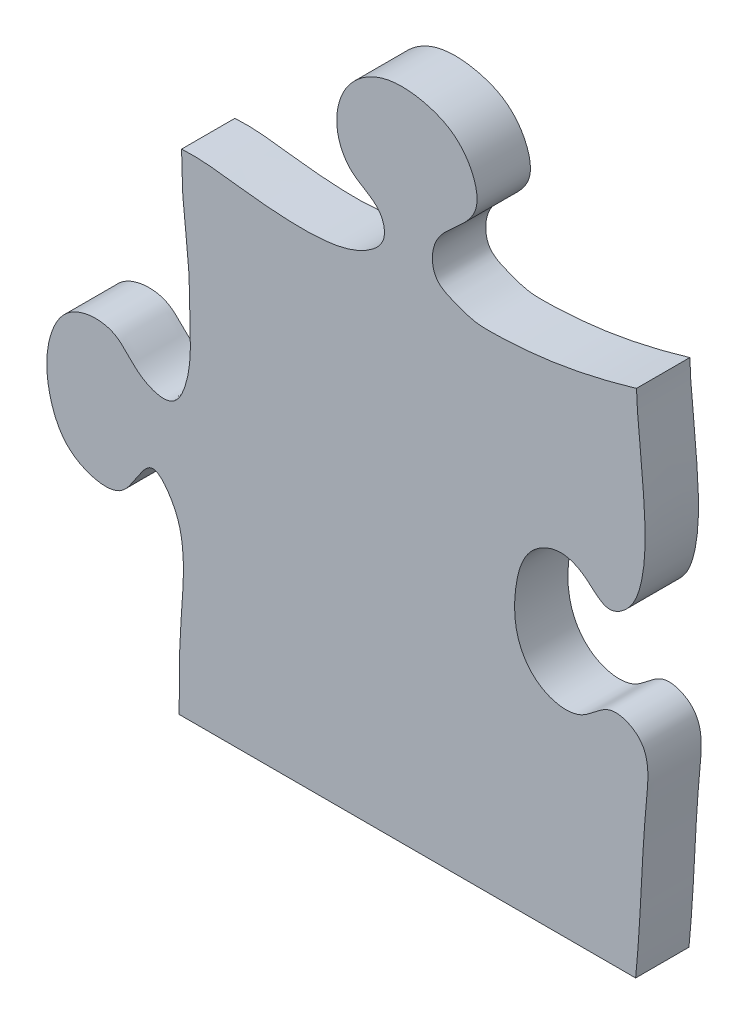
ISO-10303-21;
HEADER;
FILE_DESCRIPTION(('STEP AP214'),'2;1');
FILE_NAME('part.step','',(''),(''),'','','');
FILE_SCHEMA(('AUTOMOTIVE_DESIGN { 1 0 10303 214 1 1 1 1 }'));
ENDSEC;
DATA;
#1=APPLICATION_CONTEXT('core data for automotive mechanical design processes');
#2=APPLICATION_PROTOCOL_DEFINITION('international standard','automotive_design',2000,#1);
#3=PRODUCT_CONTEXT('',#1,'mechanical');
#4=PRODUCT('Part','Part','',(#3));
#5=PRODUCT_RELATED_PRODUCT_CATEGORY('part','',(#4));
#6=PRODUCT_DEFINITION_FORMATION('','',#4);
#7=PRODUCT_DEFINITION_CONTEXT('part definition',#1,'design');
#8=PRODUCT_DEFINITION('design','',#6,#7);
#9=PRODUCT_DEFINITION_SHAPE('','',#8);
#10=(LENGTH_UNIT() NAMED_UNIT(*) SI_UNIT(.MILLI.,.METRE.));
#11=(NAMED_UNIT(*) PLANE_ANGLE_UNIT() SI_UNIT($,.RADIAN.));
#12=(NAMED_UNIT(*) SI_UNIT($,.STERADIAN.) SOLID_ANGLE_UNIT());
#13=UNCERTAINTY_MEASURE_WITH_UNIT(LENGTH_MEASURE(1.E-05),#10,'distance_accuracy_value','');
#14=(GEOMETRIC_REPRESENTATION_CONTEXT(3) GLOBAL_UNCERTAINTY_ASSIGNED_CONTEXT((#13)) GLOBAL_UNIT_ASSIGNED_CONTEXT((#10,
#11,#12)) REPRESENTATION_CONTEXT('',''));
#15=CARTESIAN_POINT('',(0.,0.,0.));
#16=DIRECTION('',(0.,0.,1.));
#17=DIRECTION('',(1.,0.,0.));
#18=AXIS2_PLACEMENT_3D('',#15,#16,#17);
#19=CARTESIAN_POINT('',(-9.39078729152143,356.,-0.00999999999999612));
#20=CARTESIAN_POINT('',(-10.6420004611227,342.109118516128,-0.00999999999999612));
#21=CARTESIAN_POINT('',(-14.6613121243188,319.56927935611,-0.00999999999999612));
#22=CARTESIAN_POINT('',(-17.4473947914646,293.08555207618,-0.00999999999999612));
#23=CARTESIAN_POINT('',(-13.8884373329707,273.667988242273,-0.00999999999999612));
#24=CARTESIAN_POINT('',(-1.07625820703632,271.397705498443,-0.00999999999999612));
#25=CARTESIAN_POINT('',(5.29309239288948,278.450722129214,-0.00999999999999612));
#26=CARTESIAN_POINT('',(14.9258759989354,283.741247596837,-0.00999999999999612));
#27=CARTESIAN_POINT('',(28.790892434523,278.335723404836,-0.00999999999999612));
#28=CARTESIAN_POINT('',(34.7382562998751,261.206713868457,-0.00999999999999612));
#29=CARTESIAN_POINT('',(33.1132905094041,240.122633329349,-0.00999999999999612));
#30=CARTESIAN_POINT('',(14.6676977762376,229.968331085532,-0.00999999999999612));
#31=CARTESIAN_POINT('',(3.42611827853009,235.442407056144,-0.00999999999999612));
#32=CARTESIAN_POINT('',(-2.96249564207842,240.393740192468,-0.00999999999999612));
#33=CARTESIAN_POINT('',(-18.0780076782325,240.138784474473,-0.00999999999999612));
#34=CARTESIAN_POINT('',(-18.5399667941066,222.992463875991,-0.00999999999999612));
#35=CARTESIAN_POINT('',(-17.4385931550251,202.827665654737,-0.00999999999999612));
#36=CARTESIAN_POINT('',(-14.0858554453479,190.221137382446,-0.00999999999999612));
#37=CARTESIAN_POINT('',(-15.5193743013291,175.136568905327,-0.00999999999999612));
#38=CARTESIAN_POINT('',(-16.6888175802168,157.648124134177,-0.00999999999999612));
#39=CARTESIAN_POINT('',(-17.7707660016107,144.240131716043,-0.00999999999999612));
#40=CARTESIAN_POINT('',(-17.3940925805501,124.109890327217,-0.00999999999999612));
#41=CARTESIAN_POINT('',(-18.6861496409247,110.985540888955,-0.00999999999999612));
#42=CARTESIAN_POINT('',(-3.94695866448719,101.126063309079,-0.00999999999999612));
#43=CARTESIAN_POINT('',(4.50824278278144,111.148466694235,-0.00999999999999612));
#44=CARTESIAN_POINT('',(13.1578407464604,120.870763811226,-0.00999999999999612));
#45=CARTESIAN_POINT('',(29.968112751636,122.314288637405,-0.00999999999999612));
#46=CARTESIAN_POINT('',(40.7223803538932,110.783826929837,-0.00999999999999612));
#47=CARTESIAN_POINT('',(45.7909417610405,94.3968136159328,-0.00999999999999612));
#48=CARTESIAN_POINT('',(43.9390810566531,75.8787758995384,-0.00999999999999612));
#49=CARTESIAN_POINT('',(30.503103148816,62.5847389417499,-0.00999999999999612));
#50=CARTESIAN_POINT('',(14.6986660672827,64.8647821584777,-0.00999999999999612));
#51=CARTESIAN_POINT('',(6.48631275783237,74.2887035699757,-0.00999999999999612));
#52=CARTESIAN_POINT('',(-2.74495882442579,80.3019272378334,-0.00999999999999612));
#53=CARTESIAN_POINT('',(-19.8840521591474,73.8019115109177,-0.00999999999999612));
#54=CARTESIAN_POINT('',(-15.1166354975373,44.269693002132,-0.00999999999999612));
#55=CARTESIAN_POINT('',(-13.5094217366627,17.7920418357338,-0.00999999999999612));
#56=CARTESIAN_POINT('',(-10.2430798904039,-1.06342782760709,-0.00999999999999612));
#57=CARTESIAN_POINT('',(-6.15123504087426,-23.5391381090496,-0.00999999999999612));
#58=CARTESIAN_POINT('',(-4.12992604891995,-48.8436757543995,-0.00999999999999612));
#59=CARTESIAN_POINT('',(-23.2142462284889,-47.7574601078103,-0.00999999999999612));
#60=CARTESIAN_POINT('',(-30.0018234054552,-40.5423137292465,-0.00999999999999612));
#61=CARTESIAN_POINT('',(-42.7528213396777,-39.1853410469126,-0.00999999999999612));
#62=CARTESIAN_POINT('',(-57.5092962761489,-47.8418744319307,-0.00999999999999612));
#63=CARTESIAN_POINT('',(-60.2210733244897,-67.5138769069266,-0.00999999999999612));
#64=CARTESIAN_POINT('',(-54.0018378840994,-88.1567638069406,-0.00999999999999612));
#65=CARTESIAN_POINT('',(-33.5101255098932,-90.2818581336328,-0.00999999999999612));
#66=CARTESIAN_POINT('',(-26.938266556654,-78.8436195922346,-0.00999999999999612));
#67=CARTESIAN_POINT('',(-16.0575989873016,-79.9605650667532,-0.00999999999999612));
#68=CARTESIAN_POINT('',(-9.29054500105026,-89.9843542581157,-0.00999999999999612));
#69=CARTESIAN_POINT('',(-9.26037942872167,-106.547726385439,-0.00999999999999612));
#70=CARTESIAN_POINT('',(-10.8655976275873,-129.908253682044,-0.00999999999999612));
#71=CARTESIAN_POINT('',(-18.080355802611,-155.05589418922,-0.00999999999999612));
#72=CARTESIAN_POINT('',(-15.5015350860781,-180.564325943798,-0.00999999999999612));
#73=CARTESIAN_POINT('',(-13.4534563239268,-202.72625863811,-0.00999999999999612));
#74=CARTESIAN_POINT('',(-13.0721771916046,-222.761537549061,-0.00999999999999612));
#75=CARTESIAN_POINT('',(-18.0801009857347,-237.162246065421,-0.00999999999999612));
#76=CARTESIAN_POINT('',(-28.3640065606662,-243.264641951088,-0.00999999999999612));
#77=CARTESIAN_POINT('',(-35.3195309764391,-234.565632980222,-0.00999999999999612));
#78=CARTESIAN_POINT('',(-45.5220607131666,-230.442721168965,-0.00999999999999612));
#79=CARTESIAN_POINT('',(-58.2826152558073,-236.227844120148,-0.00999999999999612));
#80=CARTESIAN_POINT('',(-63.2505187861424,-252.690663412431,-0.00999999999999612));
#81=CARTESIAN_POINT('',(-62.4331763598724,-269.758175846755,-0.00999999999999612));
#82=CARTESIAN_POINT('',(-51.5712190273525,-281.475483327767,-0.00999999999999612));
#83=CARTESIAN_POINT('',(-36.6120763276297,-283.519302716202,-0.00999999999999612));
#84=CARTESIAN_POINT('',(-27.825780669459,-270.933950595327,-0.00999999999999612));
#85=CARTESIAN_POINT('',(-10.9923291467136,-277.705324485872,-0.00999999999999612));
#86=CARTESIAN_POINT('',(-14.9884890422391,-312.557066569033,-0.00999999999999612));
#87=CARTESIAN_POINT('',(-14.8626828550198,-333.640060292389,-0.00999999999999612));
#88=CARTESIAN_POINT('',(-17.0261941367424,-356.,-0.00999999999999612));
#89=B_SPLINE_CURVE_WITH_KNOTS('',3,(#19,#20,#21,#22,#23,#24,#25,#26,#27,#28,#29,#30,#31,#32,#33,
#34,#35,#36,#37,#38,#39,#40,#41,#42,#43,#44,#45,#46,#47,#48,#49,#50,#51,#52,#53,#54,#55,#56,#57,
#58,#59,#60,#61,#62,#63,#64,#65,#66,#67,#68,#69,#70,#71,#72,#73,#74,#75,#76,#77,#78,#79,#80,#81,
#82,#83,#84,#85,#86,#87,#88),.UNSPECIFIED.,.F.,.F.,(4,1,1,1,1,1,1,1,1,1,1,1,1,1,1,1,1,1,1,1,1,1,
1,1,1,1,1,1,1,1,1,1,1,1,1,1,1,1,1,1,1,1,1,1,1,1,1,1,1,1,1,1,1,1,1,1,1,1,1,1,1,1,1,1,1,1,1,4),
(0.,0.0382435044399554,0.06014267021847,0.0759154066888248,0.0830880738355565,
0.0898528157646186,0.100420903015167,0.110971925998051,0.125303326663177,0.146622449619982,
0.16313068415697,0.171984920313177,0.178976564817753,0.184846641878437,0.208558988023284,
0.213294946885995,0.232206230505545,0.247690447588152,0.25282597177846,0.280146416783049,
0.285652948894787,0.304476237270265,0.313783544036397,0.32377706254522,0.334253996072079,
0.350240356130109,0.361652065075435,0.37428972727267,0.396319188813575,0.408299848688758,
0.421251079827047,0.43387737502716,0.442611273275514,0.448402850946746,0.478919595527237,
0.50340807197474,0.525599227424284,0.531488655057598,0.562302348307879,0.569309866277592,
0.576593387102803,0.588291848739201,0.600948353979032,0.618957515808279,0.638096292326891,
0.652011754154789,0.663601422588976,0.667955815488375,0.679319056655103,0.692000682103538,
0.712742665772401,0.742765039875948,0.761777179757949,0.781638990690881,0.803327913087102,
0.815753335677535,0.82139602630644,0.831491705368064,0.840302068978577,0.85029925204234,
0.865053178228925,0.884091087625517,0.893653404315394,0.906570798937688,0.918850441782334,
0.928550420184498,0.945628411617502,1.),.UNSPECIFIED.);
#90=DIRECTION('',(0.,0.,1.));
#91=VECTOR('',#90,1.);
#92=SURFACE_OF_LINEAR_EXTRUSION('',#89,#91);
#93=CARTESIAN_POINT('',(-9.39078729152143,356.,20.));
#94=CARTESIAN_POINT('',(-10.6420004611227,342.109118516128,20.));
#95=CARTESIAN_POINT('',(-14.6613121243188,319.56927935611,20.));
#96=CARTESIAN_POINT('',(-17.4473947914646,293.08555207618,20.));
#97=CARTESIAN_POINT('',(-13.8884373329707,273.667988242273,20.));
#98=CARTESIAN_POINT('',(-1.07625820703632,271.397705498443,20.));
#99=CARTESIAN_POINT('',(5.29309239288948,278.450722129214,20.));
#100=CARTESIAN_POINT('',(14.9258759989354,283.741247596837,20.));
#101=CARTESIAN_POINT('',(28.790892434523,278.335723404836,20.));
#102=CARTESIAN_POINT('',(34.7382562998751,261.206713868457,20.));
#103=CARTESIAN_POINT('',(33.1132905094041,240.122633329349,20.));
#104=CARTESIAN_POINT('',(14.6676977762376,229.968331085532,20.));
#105=CARTESIAN_POINT('',(3.42611827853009,235.442407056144,20.));
#106=CARTESIAN_POINT('',(-2.96249564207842,240.393740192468,20.));
#107=CARTESIAN_POINT('',(-18.0780076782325,240.138784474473,20.));
#108=CARTESIAN_POINT('',(-18.5399667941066,222.992463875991,20.));
#109=CARTESIAN_POINT('',(-17.4385931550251,202.827665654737,20.));
#110=CARTESIAN_POINT('',(-14.0858554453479,190.221137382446,20.));
#111=CARTESIAN_POINT('',(-15.5193743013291,175.136568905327,20.));
#112=CARTESIAN_POINT('',(-16.6888175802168,157.648124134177,20.));
#113=CARTESIAN_POINT('',(-17.7707660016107,144.240131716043,20.));
#114=CARTESIAN_POINT('',(-17.3940925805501,124.109890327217,20.));
#115=CARTESIAN_POINT('',(-18.6861496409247,110.985540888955,20.));
#116=CARTESIAN_POINT('',(-3.94695866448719,101.126063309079,20.));
#117=CARTESIAN_POINT('',(4.50824278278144,111.148466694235,20.));
#118=CARTESIAN_POINT('',(13.1578407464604,120.870763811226,20.));
#119=CARTESIAN_POINT('',(29.968112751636,122.314288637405,20.));
#120=CARTESIAN_POINT('',(40.7223803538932,110.783826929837,20.));
#121=CARTESIAN_POINT('',(45.7909417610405,94.3968136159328,20.));
#122=CARTESIAN_POINT('',(43.9390810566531,75.8787758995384,20.));
#123=CARTESIAN_POINT('',(30.503103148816,62.5847389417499,20.));
#124=CARTESIAN_POINT('',(14.6986660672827,64.8647821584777,20.));
#125=CARTESIAN_POINT('',(6.48631275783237,74.2887035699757,20.));
#126=CARTESIAN_POINT('',(-2.74495882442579,80.3019272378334,20.));
#127=CARTESIAN_POINT('',(-19.8840521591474,73.8019115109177,20.));
#128=CARTESIAN_POINT('',(-15.1166354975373,44.269693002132,20.));
#129=CARTESIAN_POINT('',(-13.5094217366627,17.7920418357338,20.));
#130=CARTESIAN_POINT('',(-10.2430798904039,-1.06342782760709,20.));
#131=CARTESIAN_POINT('',(-6.15123504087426,-23.5391381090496,20.));
#132=CARTESIAN_POINT('',(-4.12992604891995,-48.8436757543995,20.));
#133=CARTESIAN_POINT('',(-23.2142462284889,-47.7574601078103,20.));
#134=CARTESIAN_POINT('',(-30.0018234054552,-40.5423137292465,20.));
#135=CARTESIAN_POINT('',(-42.7528213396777,-39.1853410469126,20.));
#136=CARTESIAN_POINT('',(-57.5092962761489,-47.8418744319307,20.));
#137=CARTESIAN_POINT('',(-60.2210733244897,-67.5138769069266,20.));
#138=CARTESIAN_POINT('',(-54.0018378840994,-88.1567638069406,20.));
#139=CARTESIAN_POINT('',(-33.5101255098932,-90.2818581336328,20.));
#140=CARTESIAN_POINT('',(-26.938266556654,-78.8436195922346,20.));
#141=CARTESIAN_POINT('',(-16.0575989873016,-79.9605650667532,20.));
#142=CARTESIAN_POINT('',(-9.29054500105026,-89.9843542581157,20.));
#143=CARTESIAN_POINT('',(-9.26037942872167,-106.547726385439,20.));
#144=CARTESIAN_POINT('',(-10.8655976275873,-129.908253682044,20.));
#145=CARTESIAN_POINT('',(-18.080355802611,-155.05589418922,20.));
#146=CARTESIAN_POINT('',(-15.5015350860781,-180.564325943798,20.));
#147=CARTESIAN_POINT('',(-13.4534563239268,-202.72625863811,20.));
#148=CARTESIAN_POINT('',(-13.0721771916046,-222.761537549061,20.));
#149=CARTESIAN_POINT('',(-18.0801009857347,-237.162246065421,20.));
#150=CARTESIAN_POINT('',(-28.3640065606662,-243.264641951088,20.));
#151=CARTESIAN_POINT('',(-35.3195309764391,-234.565632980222,20.));
#152=CARTESIAN_POINT('',(-45.5220607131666,-230.442721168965,20.));
#153=CARTESIAN_POINT('',(-58.2826152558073,-236.227844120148,20.));
#154=CARTESIAN_POINT('',(-63.2505187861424,-252.690663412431,20.));
#155=CARTESIAN_POINT('',(-62.4331763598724,-269.758175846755,20.));
#156=CARTESIAN_POINT('',(-51.5712190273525,-281.475483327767,20.));
#157=CARTESIAN_POINT('',(-36.6120763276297,-283.519302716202,20.));
#158=CARTESIAN_POINT('',(-27.825780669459,-270.933950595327,20.));
#159=CARTESIAN_POINT('',(-10.9923291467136,-277.705324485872,20.));
#160=CARTESIAN_POINT('',(-14.9884890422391,-312.557066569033,20.));
#161=CARTESIAN_POINT('',(-14.8626828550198,-333.640060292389,20.));
#162=CARTESIAN_POINT('',(-17.0261941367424,-356.,20.));
#163=B_SPLINE_CURVE_WITH_KNOTS('',3,(#93,#94,#95,#96,#97,#98,#99,#100,#101,#102,#103,#104,#105,
#106,#107,#108,#109,#110,#111,#112,#113,#114,#115,#116,#117,#118,#119,#120,#121,#122,#123,#124,
#125,#126,#127,#128,#129,#130,#131,#132,#133,#134,#135,#136,#137,#138,#139,#140,#141,#142,#143,
#144,#145,#146,#147,#148,#149,#150,#151,#152,#153,#154,#155,#156,#157,#158,#159,#160,#161,#162),
.UNSPECIFIED.,.F.,.F.,(4,1,1,1,1,1,1,1,1,1,1,1,1,1,1,1,1,1,1,1,1,1,1,1,1,1,1,1,1,1,1,1,1,1,1,1,
1,1,1,1,1,1,1,1,1,1,1,1,1,1,1,1,1,1,1,1,1,1,1,1,1,1,1,1,1,1,1,4),(0.,0.0382435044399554,
0.06014267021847,0.0759154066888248,0.0830880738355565,0.0898528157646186,0.100420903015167,
0.110971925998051,0.125303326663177,0.146622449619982,0.16313068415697,0.171984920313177,
0.178976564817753,0.184846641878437,0.208558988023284,0.213294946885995,0.232206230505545,
0.247690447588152,0.25282597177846,0.280146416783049,0.285652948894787,0.304476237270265,
0.313783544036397,0.32377706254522,0.334253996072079,0.350240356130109,0.361652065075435,
0.37428972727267,0.396319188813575,0.408299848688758,0.421251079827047,0.43387737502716,
0.442611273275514,0.448402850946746,0.478919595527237,0.50340807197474,0.525599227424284,
0.531488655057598,0.562302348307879,0.569309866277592,0.576593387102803,0.588291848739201,
0.600948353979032,0.618957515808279,0.638096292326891,0.652011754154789,0.663601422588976,
0.667955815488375,0.679319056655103,0.692000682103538,0.712742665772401,0.742765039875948,
0.761777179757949,0.781638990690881,0.803327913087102,0.815753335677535,0.82139602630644,
0.831491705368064,0.840302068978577,0.85029925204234,0.865053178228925,0.884091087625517,
0.893653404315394,0.906570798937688,0.918850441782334,0.928550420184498,0.945628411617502,1.),.UNSPECIFIED.);
#164=CARTESIAN_POINT('',(-16.6986782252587,-164.35007147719,20.));
#165=VERTEX_POINT('',#164);
#166=CARTESIAN_POINT('',(-17.0261941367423,-356.,20.));
#167=VERTEX_POINT('',#166);
#168=EDGE_CURVE('E94',#165,#167,#163,.T.);
#169=ORIENTED_EDGE('',*,*,#168,.T.);
#170=DIRECTION('',(0.,0.,1.));
#171=VECTOR('',#170,1.);
#172=CARTESIAN_POINT('',(-17.0261941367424,-356.,-0.00999999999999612));
#173=LINE('',#172,#171);
#174=CARTESIAN_POINT('',(-17.0261941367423,-356.,0.));
#175=VERTEX_POINT('',#174);
#176=EDGE_CURVE('E110',#175,#167,#173,.T.);
#177=ORIENTED_EDGE('',*,*,#176,.F.);
#178=CARTESIAN_POINT('',(-9.39078729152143,356.,0.));
#179=CARTESIAN_POINT('',(-10.6420004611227,342.109118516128,0.));
#180=CARTESIAN_POINT('',(-14.6613121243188,319.56927935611,0.));
#181=CARTESIAN_POINT('',(-17.4473947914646,293.08555207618,0.));
#182=CARTESIAN_POINT('',(-13.8884373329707,273.667988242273,0.));
#183=CARTESIAN_POINT('',(-1.07625820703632,271.397705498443,0.));
#184=CARTESIAN_POINT('',(5.29309239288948,278.450722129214,0.));
#185=CARTESIAN_POINT('',(14.9258759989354,283.741247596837,0.));
#186=CARTESIAN_POINT('',(28.790892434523,278.335723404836,0.));
#187=CARTESIAN_POINT('',(34.7382562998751,261.206713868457,0.));
#188=CARTESIAN_POINT('',(33.1132905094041,240.122633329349,0.));
#189=CARTESIAN_POINT('',(14.6676977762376,229.968331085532,0.));
#190=CARTESIAN_POINT('',(3.42611827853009,235.442407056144,0.));
#191=CARTESIAN_POINT('',(-2.96249564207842,240.393740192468,0.));
#192=CARTESIAN_POINT('',(-18.0780076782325,240.138784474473,0.));
#193=CARTESIAN_POINT('',(-18.5399667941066,222.992463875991,0.));
#194=CARTESIAN_POINT('',(-17.4385931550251,202.827665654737,0.));
#195=CARTESIAN_POINT('',(-14.0858554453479,190.221137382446,0.));
#196=CARTESIAN_POINT('',(-15.5193743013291,175.136568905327,0.));
#197=CARTESIAN_POINT('',(-16.6888175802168,157.648124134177,0.));
#198=CARTESIAN_POINT('',(-17.7707660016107,144.240131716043,0.));
#199=CARTESIAN_POINT('',(-17.3940925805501,124.109890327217,0.));
#200=CARTESIAN_POINT('',(-18.6861496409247,110.985540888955,0.));
#201=CARTESIAN_POINT('',(-3.94695866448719,101.126063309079,0.));
#202=CARTESIAN_POINT('',(4.50824278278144,111.148466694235,0.));
#203=CARTESIAN_POINT('',(13.1578407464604,120.870763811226,0.));
#204=CARTESIAN_POINT('',(29.968112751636,122.314288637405,0.));
#205=CARTESIAN_POINT('',(40.7223803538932,110.783826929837,0.));
#206=CARTESIAN_POINT('',(45.7909417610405,94.3968136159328,0.));
#207=CARTESIAN_POINT('',(43.9390810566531,75.8787758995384,0.));
#208=CARTESIAN_POINT('',(30.503103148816,62.5847389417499,0.));
#209=CARTESIAN_POINT('',(14.6986660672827,64.8647821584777,0.));
#210=CARTESIAN_POINT('',(6.48631275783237,74.2887035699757,0.));
#211=CARTESIAN_POINT('',(-2.74495882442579,80.3019272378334,0.));
#212=CARTESIAN_POINT('',(-19.8840521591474,73.8019115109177,0.));
#213=CARTESIAN_POINT('',(-15.1166354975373,44.269693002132,0.));
#214=CARTESIAN_POINT('',(-13.5094217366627,17.7920418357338,0.));
#215=CARTESIAN_POINT('',(-10.2430798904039,-1.06342782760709,0.));
#216=CARTESIAN_POINT('',(-6.15123504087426,-23.5391381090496,0.));
#217=CARTESIAN_POINT('',(-4.12992604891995,-48.8436757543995,0.));
#218=CARTESIAN_POINT('',(-23.2142462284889,-47.7574601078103,0.));
#219=CARTESIAN_POINT('',(-30.0018234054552,-40.5423137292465,0.));
#220=CARTESIAN_POINT('',(-42.7528213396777,-39.1853410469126,0.));
#221=CARTESIAN_POINT('',(-57.5092962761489,-47.8418744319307,0.));
#222=CARTESIAN_POINT('',(-60.2210733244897,-67.5138769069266,0.));
#223=CARTESIAN_POINT('',(-54.0018378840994,-88.1567638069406,0.));
#224=CARTESIAN_POINT('',(-33.5101255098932,-90.2818581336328,0.));
#225=CARTESIAN_POINT('',(-26.938266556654,-78.8436195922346,0.));
#226=CARTESIAN_POINT('',(-16.0575989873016,-79.9605650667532,0.));
#227=CARTESIAN_POINT('',(-9.29054500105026,-89.9843542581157,0.));
#228=CARTESIAN_POINT('',(-9.26037942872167,-106.547726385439,0.));
#229=CARTESIAN_POINT('',(-10.8655976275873,-129.908253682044,0.));
#230=CARTESIAN_POINT('',(-18.080355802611,-155.05589418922,0.));
#231=CARTESIAN_POINT('',(-15.5015350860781,-180.564325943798,0.));
#232=CARTESIAN_POINT('',(-13.4534563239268,-202.72625863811,0.));
#233=CARTESIAN_POINT('',(-13.0721771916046,-222.761537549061,0.));
#234=CARTESIAN_POINT('',(-18.0801009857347,-237.162246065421,0.));
#235=CARTESIAN_POINT('',(-28.3640065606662,-243.264641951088,0.));
#236=CARTESIAN_POINT('',(-35.3195309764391,-234.565632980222,0.));
#237=CARTESIAN_POINT('',(-45.5220607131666,-230.442721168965,0.));
#238=CARTESIAN_POINT('',(-58.2826152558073,-236.227844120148,0.));
#239=CARTESIAN_POINT('',(-63.2505187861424,-252.690663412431,0.));
#240=CARTESIAN_POINT('',(-62.4331763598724,-269.758175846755,0.));
#241=CARTESIAN_POINT('',(-51.5712190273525,-281.475483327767,0.));
#242=CARTESIAN_POINT('',(-36.6120763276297,-283.519302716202,0.));
#243=CARTESIAN_POINT('',(-27.825780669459,-270.933950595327,0.));
#244=CARTESIAN_POINT('',(-10.9923291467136,-277.705324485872,0.));
#245=CARTESIAN_POINT('',(-14.9884890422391,-312.557066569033,0.));
#246=CARTESIAN_POINT('',(-14.8626828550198,-333.640060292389,0.));
#247=CARTESIAN_POINT('',(-17.0261941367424,-356.,0.));
#248=B_SPLINE_CURVE_WITH_KNOTS('',3,(#178,#179,#180,#181,#182,#183,#184,#185,#186,#187,#188,
#189,#190,#191,#192,#193,#194,#195,#196,#197,#198,#199,#200,#201,#202,#203,#204,#205,#206,#207,
#208,#209,#210,#211,#212,#213,#214,#215,#216,#217,#218,#219,#220,#221,#222,#223,#224,#225,#226,
#227,#228,#229,#230,#231,#232,#233,#234,#235,#236,#237,#238,#239,#240,#241,#242,#243,#244,#245,
#246,#247),.UNSPECIFIED.,.F.,.F.,(4,1,1,1,1,1,1,1,1,1,1,1,1,1,1,1,1,1,1,1,1,1,1,1,1,1,1,1,1,1,1,
1,1,1,1,1,1,1,1,1,1,1,1,1,1,1,1,1,1,1,1,1,1,1,1,1,1,1,1,1,1,1,1,1,1,1,1,4),(0.,
0.0382435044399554,0.06014267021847,0.0759154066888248,0.0830880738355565,0.0898528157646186,
0.100420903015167,0.110971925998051,0.125303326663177,0.146622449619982,0.16313068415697,
0.171984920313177,0.178976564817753,0.184846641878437,0.208558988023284,0.213294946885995,
0.232206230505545,0.247690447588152,0.25282597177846,0.280146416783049,0.285652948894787,
0.304476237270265,0.313783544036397,0.32377706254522,0.334253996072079,0.350240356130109,
0.361652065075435,0.37428972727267,0.396319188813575,0.408299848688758,0.421251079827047,
0.43387737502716,0.442611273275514,0.448402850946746,0.478919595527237,0.50340807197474,
0.525599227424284,0.531488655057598,0.562302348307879,0.569309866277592,0.576593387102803,
0.588291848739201,0.600948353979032,0.618957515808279,0.638096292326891,0.652011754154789,
0.663601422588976,0.667955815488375,0.679319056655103,0.692000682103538,0.712742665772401,
0.742765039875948,0.761777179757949,0.781638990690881,0.803327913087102,0.815753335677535,
0.82139602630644,0.831491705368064,0.840302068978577,0.85029925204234,0.865053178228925,
0.884091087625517,0.893653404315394,0.906570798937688,0.918850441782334,0.928550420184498,
0.945628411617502,1.),.UNSPECIFIED.);
#249=CARTESIAN_POINT('',(-16.6986782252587,-164.35007147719,0.));
#250=VERTEX_POINT('',#249);
#251=EDGE_CURVE('E59',#250,#175,#248,.T.);
#252=ORIENTED_EDGE('',*,*,#251,.F.);
#253=DIRECTION('',(0.,0.,1.));
#254=VECTOR('',#253,1.);
#255=CARTESIAN_POINT('',(-16.6986782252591,-164.350071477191,-0.00999999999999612));
#256=LINE('',#255,#254);
#257=EDGE_CURVE('E52',#165,#250,#256,.F.);
#258=ORIENTED_EDGE('',*,*,#257,.F.);
#259=EDGE_LOOP('',(#169,#177,#252,#258));
#260=FACE_BOUND('',#259,.T.);
#261=ADVANCED_FACE('F34',(#260),#92,.F.);
#262=CARTESIAN_POINT('',(-186.393246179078,356.,-0.00999999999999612));
#263=CARTESIAN_POINT('',(-186.465644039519,346.788250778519,-0.00999999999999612));
#264=CARTESIAN_POINT('',(-188.628884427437,329.478394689,-0.00999999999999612));
#265=CARTESIAN_POINT('',(-190.429976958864,304.816732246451,-0.00999999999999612));
#266=CARTESIAN_POINT('',(-187.884620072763,287.022607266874,-0.00999999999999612));
#267=CARTESIAN_POINT('',(-177.83183487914,273.701157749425,-0.00999999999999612));
#268=CARTESIAN_POINT('',(-167.372440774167,281.069990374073,-0.00999999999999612));
#269=CARTESIAN_POINT('',(-162.424812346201,293.671302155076,-0.00999999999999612));
#270=CARTESIAN_POINT('',(-138.980403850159,295.954762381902,-0.00999999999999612));
#271=CARTESIAN_POINT('',(-129.023505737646,274.502332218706,-0.00999999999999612));
#272=CARTESIAN_POINT('',(-130.151753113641,256.130310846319,-0.00999999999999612));
#273=CARTESIAN_POINT('',(-138.180313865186,240.882815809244,-0.00999999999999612));
#274=CARTESIAN_POINT('',(-153.903325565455,237.974697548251,-0.00999999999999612));
#275=CARTESIAN_POINT('',(-162.781582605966,247.270783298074,-0.00999999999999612));
#276=CARTESIAN_POINT('',(-171.61954140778,254.983724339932,-0.00999999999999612));
#277=CARTESIAN_POINT('',(-186.267660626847,251.663377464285,-0.00999999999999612));
#278=CARTESIAN_POINT('',(-188.178219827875,226.271427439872,-0.00999999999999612));
#279=CARTESIAN_POINT('',(-186.828985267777,214.10322906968,-0.00999999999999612));
#280=CARTESIAN_POINT('',(-182.631402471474,181.666904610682,-0.00999999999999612));
#281=CARTESIAN_POINT('',(-187.119801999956,157.75465666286,-0.00999999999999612));
#282=CARTESIAN_POINT('',(-187.457937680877,142.904539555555,-0.00999999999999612));
#283=CARTESIAN_POINT('',(-184.089404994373,126.204275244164,-0.00999999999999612));
#284=CARTESIAN_POINT('',(-168.499206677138,126.488047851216,-0.00999999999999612));
#285=CARTESIAN_POINT('',(-158.423592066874,136.759079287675,-0.00999999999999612));
#286=CARTESIAN_POINT('',(-133.598254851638,130.460350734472,-0.00999999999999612));
#287=CARTESIAN_POINT('',(-132.174041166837,109.25711139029,-0.00999999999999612));
#288=CARTESIAN_POINT('',(-137.401430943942,84.0677449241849,-0.00999999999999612));
#289=CARTESIAN_POINT('',(-159.905312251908,82.8448138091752,-0.00999999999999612));
#290=CARTESIAN_POINT('',(-167.594499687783,95.2630828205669,-0.00999999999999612));
#291=CARTESIAN_POINT('',(-184.064608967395,90.371493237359,-0.00999999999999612));
#292=CARTESIAN_POINT('',(-186.999172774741,63.1173196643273,-0.00999999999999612));
#293=CARTESIAN_POINT('',(-188.17555036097,34.3474510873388,-0.00999999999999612));
#294=CARTESIAN_POINT('',(-189.520016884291,-1.94344937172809,-0.00999999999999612));
#295=CARTESIAN_POINT('',(-192.230906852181,-38.9111914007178,-0.00999999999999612));
#296=CARTESIAN_POINT('',(-193.196462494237,-56.4819013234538,-0.00999999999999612));
#297=CARTESIAN_POINT('',(-187.787083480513,-81.0819408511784,-0.00999999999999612));
#298=CARTESIAN_POINT('',(-174.027975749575,-78.613025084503,-0.00999999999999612));
#299=CARTESIAN_POINT('',(-167.64120428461,-66.7586676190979,-0.00999999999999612));
#300=CARTESIAN_POINT('',(-138.878579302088,-69.8200733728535,-0.00999999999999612));
#301=CARTESIAN_POINT('',(-138.315063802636,-94.39593724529,-0.00999999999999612));
#302=CARTESIAN_POINT('',(-145.951566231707,-114.49908529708,-0.00999999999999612));
#303=CARTESIAN_POINT('',(-163.555921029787,-121.175747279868,-0.00999999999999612));
#304=CARTESIAN_POINT('',(-172.11578880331,-114.919909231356,-0.00999999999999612));
#305=CARTESIAN_POINT('',(-176.485425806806,-107.364168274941,-0.00999999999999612));
#306=CARTESIAN_POINT('',(-184.309097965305,-107.607264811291,-0.00999999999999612));
#307=CARTESIAN_POINT('',(-188.561946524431,-116.100575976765,-0.00999999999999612));
#308=CARTESIAN_POINT('',(-189.834439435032,-132.751458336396,-0.00999999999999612));
#309=CARTESIAN_POINT('',(-188.899668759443,-143.69775261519,-0.00999999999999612));
#310=CARTESIAN_POINT('',(-186.87437190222,-176.639875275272,-0.00999999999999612));
#311=CARTESIAN_POINT('',(-187.115886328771,-188.95785352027,-0.00999999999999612));
#312=CARTESIAN_POINT('',(-184.068917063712,-208.490912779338,-0.00999999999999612));
#313=CARTESIAN_POINT('',(-184.462371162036,-228.434350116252,-0.00999999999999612));
#314=CARTESIAN_POINT('',(-182.717405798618,-241.744671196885,-0.00999999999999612));
#315=CARTESIAN_POINT('',(-190.107123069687,-258.646375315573,-0.00999999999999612));
#316=CARTESIAN_POINT('',(-204.50360377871,-253.849993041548,-0.00999999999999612));
#317=CARTESIAN_POINT('',(-211.768269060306,-241.698033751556,-0.00999999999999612));
#318=CARTESIAN_POINT('',(-230.141572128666,-243.165284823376,-0.00999999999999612));
#319=CARTESIAN_POINT('',(-238.864067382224,-259.702852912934,-0.00999999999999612));
#320=CARTESIAN_POINT('',(-237.82033634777,-276.944530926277,-0.00999999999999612));
#321=CARTESIAN_POINT('',(-229.688332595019,-293.402921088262,-0.00999999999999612));
#322=CARTESIAN_POINT('',(-210.804716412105,-298.51720908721,-0.00999999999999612));
#323=CARTESIAN_POINT('',(-204.725260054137,-287.600226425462,-0.00999999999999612));
#324=CARTESIAN_POINT('',(-198.130842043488,-278.388409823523,-0.00999999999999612));
#325=CARTESIAN_POINT('',(-189.724281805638,-288.428094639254,-0.00999999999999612));
#326=CARTESIAN_POINT('',(-185.110914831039,-304.121783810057,-0.00999999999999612));
#327=CARTESIAN_POINT('',(-188.504639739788,-328.326605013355,-0.00999999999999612));
#328=CARTESIAN_POINT('',(-188.031330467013,-347.655914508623,-0.00999999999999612));
#329=CARTESIAN_POINT('',(-188.197680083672,-356.,-0.00999999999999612));
#330=B_SPLINE_CURVE_WITH_KNOTS('',3,(#262,#263,#264,#265,#266,#267,#268,#269,#270,#271,#272,
#273,#274,#275,#276,#277,#278,#279,#280,#281,#282,#283,#284,#285,#286,#287,#288,#289,#290,#291,
#292,#293,#294,#295,#296,#297,#298,#299,#300,#301,#302,#303,#304,#305,#306,#307,#308,#309,#310,
#311,#312,#313,#314,#315,#316,#317,#318,#319,#320,#321,#322,#323,#324,#325,#326,#327,#328,#329),
.UNSPECIFIED.,.F.,.F.,(4,1,1,1,1,1,1,1,1,1,1,1,1,1,1,1,1,1,1,1,1,1,1,1,1,1,1,1,1,1,1,1,1,1,1,1,
1,1,1,1,1,1,1,1,1,1,1,1,1,1,1,1,1,1,1,1,1,1,1,1,1,1,1,1,1,4),(0.,0.0262331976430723,
0.050560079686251,0.0695219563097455,0.0800713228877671,0.0885051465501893,0.099482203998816,
0.118619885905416,0.138837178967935,0.157899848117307,0.171291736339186,0.185151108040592,
0.19559453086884,0.206745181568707,0.217337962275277,0.230877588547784,0.26409725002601,
0.28835141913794,0.305292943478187,0.32505690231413,0.334743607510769,0.348191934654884,
0.358741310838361,0.375812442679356,0.401272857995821,0.416827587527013,0.432882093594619,
0.444490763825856,0.458014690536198,0.481063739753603,0.510647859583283,0.548186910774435,
0.587648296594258,0.610908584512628,0.621783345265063,0.631931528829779,0.643591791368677,
0.658807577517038,0.686126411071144,0.703957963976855,0.718649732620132,0.731300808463,
0.735266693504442,0.736591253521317,0.743662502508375,0.746501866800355,0.76410099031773,
0.785041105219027,0.790214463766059,0.812987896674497,0.817887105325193,0.836359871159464,
0.84408330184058,0.853053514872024,0.86313504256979,0.875355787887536,0.885829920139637,
0.902341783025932,0.912788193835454,0.926625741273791,0.934943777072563,0.940543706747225,
0.946912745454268,0.957064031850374,0.980148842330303,1.),.UNSPECIFIED.);
#331=DIRECTION('',(0.,0.,1.));
#332=VECTOR('',#331,1.);
#333=SURFACE_OF_LINEAR_EXTRUSION('',#330,#332);
#334=CARTESIAN_POINT('',(-186.393246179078,356.,20.));
#335=CARTESIAN_POINT('',(-186.465644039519,346.788250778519,20.));
#336=CARTESIAN_POINT('',(-188.628884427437,329.478394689,20.));
#337=CARTESIAN_POINT('',(-190.429976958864,304.816732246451,20.));
#338=CARTESIAN_POINT('',(-187.884620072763,287.022607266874,20.));
#339=CARTESIAN_POINT('',(-177.83183487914,273.701157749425,20.));
#340=CARTESIAN_POINT('',(-167.372440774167,281.069990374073,20.));
#341=CARTESIAN_POINT('',(-162.424812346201,293.671302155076,20.));
#342=CARTESIAN_POINT('',(-138.980403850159,295.954762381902,20.));
#343=CARTESIAN_POINT('',(-129.023505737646,274.502332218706,20.));
#344=CARTESIAN_POINT('',(-130.151753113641,256.130310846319,20.));
#345=CARTESIAN_POINT('',(-138.180313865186,240.882815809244,20.));
#346=CARTESIAN_POINT('',(-153.903325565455,237.974697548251,20.));
#347=CARTESIAN_POINT('',(-162.781582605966,247.270783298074,20.));
#348=CARTESIAN_POINT('',(-171.61954140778,254.983724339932,20.));
#349=CARTESIAN_POINT('',(-186.267660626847,251.663377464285,20.));
#350=CARTESIAN_POINT('',(-188.178219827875,226.271427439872,20.));
#351=CARTESIAN_POINT('',(-186.828985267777,214.10322906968,20.));
#352=CARTESIAN_POINT('',(-182.631402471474,181.666904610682,20.));
#353=CARTESIAN_POINT('',(-187.119801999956,157.75465666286,20.));
#354=CARTESIAN_POINT('',(-187.457937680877,142.904539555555,20.));
#355=CARTESIAN_POINT('',(-184.089404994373,126.204275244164,20.));
#356=CARTESIAN_POINT('',(-168.499206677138,126.488047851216,20.));
#357=CARTESIAN_POINT('',(-158.423592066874,136.759079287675,20.));
#358=CARTESIAN_POINT('',(-133.598254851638,130.460350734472,20.));
#359=CARTESIAN_POINT('',(-132.174041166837,109.25711139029,20.));
#360=CARTESIAN_POINT('',(-137.401430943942,84.0677449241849,20.));
#361=CARTESIAN_POINT('',(-159.905312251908,82.8448138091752,20.));
#362=CARTESIAN_POINT('',(-167.594499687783,95.2630828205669,20.));
#363=CARTESIAN_POINT('',(-184.064608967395,90.371493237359,20.));
#364=CARTESIAN_POINT('',(-186.999172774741,63.1173196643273,20.));
#365=CARTESIAN_POINT('',(-188.17555036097,34.3474510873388,20.));
#366=CARTESIAN_POINT('',(-189.520016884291,-1.94344937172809,20.));
#367=CARTESIAN_POINT('',(-192.230906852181,-38.9111914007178,20.));
#368=CARTESIAN_POINT('',(-193.196462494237,-56.4819013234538,20.));
#369=CARTESIAN_POINT('',(-187.787083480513,-81.0819408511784,20.));
#370=CARTESIAN_POINT('',(-174.027975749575,-78.613025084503,20.));
#371=CARTESIAN_POINT('',(-167.64120428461,-66.7586676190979,20.));
#372=CARTESIAN_POINT('',(-138.878579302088,-69.8200733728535,20.));
#373=CARTESIAN_POINT('',(-138.315063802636,-94.39593724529,20.));
#374=CARTESIAN_POINT('',(-145.951566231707,-114.49908529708,20.));
#375=CARTESIAN_POINT('',(-163.555921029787,-121.175747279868,20.));
#376=CARTESIAN_POINT('',(-172.11578880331,-114.919909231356,20.));
#377=CARTESIAN_POINT('',(-176.485425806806,-107.364168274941,20.));
#378=CARTESIAN_POINT('',(-184.309097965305,-107.607264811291,20.));
#379=CARTESIAN_POINT('',(-188.561946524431,-116.100575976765,20.));
#380=CARTESIAN_POINT('',(-189.834439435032,-132.751458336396,20.));
#381=CARTESIAN_POINT('',(-188.899668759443,-143.69775261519,20.));
#382=CARTESIAN_POINT('',(-186.87437190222,-176.639875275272,20.));
#383=CARTESIAN_POINT('',(-187.115886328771,-188.95785352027,20.));
#384=CARTESIAN_POINT('',(-184.068917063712,-208.490912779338,20.));
#385=CARTESIAN_POINT('',(-184.462371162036,-228.434350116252,20.));
#386=CARTESIAN_POINT('',(-182.717405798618,-241.744671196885,20.));
#387=CARTESIAN_POINT('',(-190.107123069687,-258.646375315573,20.));
#388=CARTESIAN_POINT('',(-204.50360377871,-253.849993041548,20.));
#389=CARTESIAN_POINT('',(-211.768269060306,-241.698033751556,20.));
#390=CARTESIAN_POINT('',(-230.141572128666,-243.165284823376,20.));
#391=CARTESIAN_POINT('',(-238.864067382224,-259.702852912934,20.));
#392=CARTESIAN_POINT('',(-237.82033634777,-276.944530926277,20.));
#393=CARTESIAN_POINT('',(-229.688332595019,-293.402921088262,20.));
#394=CARTESIAN_POINT('',(-210.804716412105,-298.51720908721,20.));
#395=CARTESIAN_POINT('',(-204.725260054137,-287.600226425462,20.));
#396=CARTESIAN_POINT('',(-198.130842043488,-278.388409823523,20.));
#397=CARTESIAN_POINT('',(-189.724281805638,-288.428094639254,20.));
#398=CARTESIAN_POINT('',(-185.110914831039,-304.121783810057,20.));
#399=CARTESIAN_POINT('',(-188.504639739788,-328.326605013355,20.));
#400=CARTESIAN_POINT('',(-188.031330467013,-347.655914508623,20.));
#401=CARTESIAN_POINT('',(-188.197680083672,-356.,20.));
#402=B_SPLINE_CURVE_WITH_KNOTS('',3,(#334,#335,#336,#337,#338,#339,#340,#341,#342,#343,#344,
#345,#346,#347,#348,#349,#350,#351,#352,#353,#354,#355,#356,#357,#358,#359,#360,#361,#362,#363,
#364,#365,#366,#367,#368,#369,#370,#371,#372,#373,#374,#375,#376,#377,#378,#379,#380,#381,#382,
#383,#384,#385,#386,#387,#388,#389,#390,#391,#392,#393,#394,#395,#396,#397,#398,#399,#400,#401),
.UNSPECIFIED.,.F.,.F.,(4,1,1,1,1,1,1,1,1,1,1,1,1,1,1,1,1,1,1,1,1,1,1,1,1,1,1,1,1,1,1,1,1,1,1,1,
1,1,1,1,1,1,1,1,1,1,1,1,1,1,1,1,1,1,1,1,1,1,1,1,1,1,1,1,1,4),(0.,0.0262331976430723,
0.050560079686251,0.0695219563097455,0.0800713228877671,0.0885051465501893,0.099482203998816,
0.118619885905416,0.138837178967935,0.157899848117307,0.171291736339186,0.185151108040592,
0.19559453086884,0.206745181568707,0.217337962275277,0.230877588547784,0.26409725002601,
0.28835141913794,0.305292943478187,0.32505690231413,0.334743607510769,0.348191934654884,
0.358741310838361,0.375812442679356,0.401272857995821,0.416827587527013,0.432882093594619,
0.444490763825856,0.458014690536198,0.481063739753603,0.510647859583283,0.548186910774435,
0.587648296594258,0.610908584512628,0.621783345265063,0.631931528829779,0.643591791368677,
0.658807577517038,0.686126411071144,0.703957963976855,0.718649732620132,0.731300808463,
0.735266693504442,0.736591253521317,0.743662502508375,0.746501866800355,0.76410099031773,
0.785041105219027,0.790214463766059,0.812987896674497,0.817887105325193,0.836359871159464,
0.84408330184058,0.853053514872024,0.86313504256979,0.875355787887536,0.885829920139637,
0.902341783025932,0.912788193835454,0.926625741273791,0.934943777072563,0.940543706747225,
0.946912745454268,0.957064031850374,0.980148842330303,1.),.UNSPECIFIED.);
#403=CARTESIAN_POINT('',(-187.287524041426,-171.956059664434,20.));
#404=VERTEX_POINT('',#403);
#405=CARTESIAN_POINT('',(-188.197680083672,-356.,20.));
#406=VERTEX_POINT('',#405);
#407=EDGE_CURVE('E87',#404,#406,#402,.T.);
#408=ORIENTED_EDGE('',*,*,#407,.F.);
#409=DIRECTION('',(0.,0.,1.));
#410=VECTOR('',#409,1.);
#411=CARTESIAN_POINT('',(-187.287524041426,-171.956059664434,-0.00999999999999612));
#412=LINE('',#411,#410);
#413=CARTESIAN_POINT('',(-187.287524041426,-171.956059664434,0.));
#414=VERTEX_POINT('',#413);
#415=EDGE_CURVE('E78',#404,#414,#412,.F.);
#416=ORIENTED_EDGE('',*,*,#415,.T.);
#417=CARTESIAN_POINT('',(-186.393246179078,356.,0.));
#418=CARTESIAN_POINT('',(-186.465644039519,346.788250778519,0.));
#419=CARTESIAN_POINT('',(-188.628884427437,329.478394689,0.));
#420=CARTESIAN_POINT('',(-190.429976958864,304.816732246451,0.));
#421=CARTESIAN_POINT('',(-187.884620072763,287.022607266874,0.));
#422=CARTESIAN_POINT('',(-177.83183487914,273.701157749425,0.));
#423=CARTESIAN_POINT('',(-167.372440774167,281.069990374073,0.));
#424=CARTESIAN_POINT('',(-162.424812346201,293.671302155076,0.));
#425=CARTESIAN_POINT('',(-138.980403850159,295.954762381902,0.));
#426=CARTESIAN_POINT('',(-129.023505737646,274.502332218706,0.));
#427=CARTESIAN_POINT('',(-130.151753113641,256.130310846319,0.));
#428=CARTESIAN_POINT('',(-138.180313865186,240.882815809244,0.));
#429=CARTESIAN_POINT('',(-153.903325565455,237.974697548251,0.));
#430=CARTESIAN_POINT('',(-162.781582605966,247.270783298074,0.));
#431=CARTESIAN_POINT('',(-171.61954140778,254.983724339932,0.));
#432=CARTESIAN_POINT('',(-186.267660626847,251.663377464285,0.));
#433=CARTESIAN_POINT('',(-188.178219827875,226.271427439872,0.));
#434=CARTESIAN_POINT('',(-186.828985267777,214.10322906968,0.));
#435=CARTESIAN_POINT('',(-182.631402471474,181.666904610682,0.));
#436=CARTESIAN_POINT('',(-187.119801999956,157.75465666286,0.));
#437=CARTESIAN_POINT('',(-187.457937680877,142.904539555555,0.));
#438=CARTESIAN_POINT('',(-184.089404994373,126.204275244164,0.));
#439=CARTESIAN_POINT('',(-168.499206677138,126.488047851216,0.));
#440=CARTESIAN_POINT('',(-158.423592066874,136.759079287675,0.));
#441=CARTESIAN_POINT('',(-133.598254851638,130.460350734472,0.));
#442=CARTESIAN_POINT('',(-132.174041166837,109.25711139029,0.));
#443=CARTESIAN_POINT('',(-137.401430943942,84.0677449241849,0.));
#444=CARTESIAN_POINT('',(-159.905312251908,82.8448138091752,0.));
#445=CARTESIAN_POINT('',(-167.594499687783,95.2630828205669,0.));
#446=CARTESIAN_POINT('',(-184.064608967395,90.371493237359,0.));
#447=CARTESIAN_POINT('',(-186.999172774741,63.1173196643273,0.));
#448=CARTESIAN_POINT('',(-188.17555036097,34.3474510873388,0.));
#449=CARTESIAN_POINT('',(-189.520016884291,-1.94344937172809,0.));
#450=CARTESIAN_POINT('',(-192.230906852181,-38.9111914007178,0.));
#451=CARTESIAN_POINT('',(-193.196462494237,-56.4819013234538,0.));
#452=CARTESIAN_POINT('',(-187.787083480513,-81.0819408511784,0.));
#453=CARTESIAN_POINT('',(-174.027975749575,-78.613025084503,0.));
#454=CARTESIAN_POINT('',(-167.64120428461,-66.7586676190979,0.));
#455=CARTESIAN_POINT('',(-138.878579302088,-69.8200733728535,0.));
#456=CARTESIAN_POINT('',(-138.315063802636,-94.39593724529,0.));
#457=CARTESIAN_POINT('',(-145.951566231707,-114.49908529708,0.));
#458=CARTESIAN_POINT('',(-163.555921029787,-121.175747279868,0.));
#459=CARTESIAN_POINT('',(-172.11578880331,-114.919909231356,0.));
#460=CARTESIAN_POINT('',(-176.485425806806,-107.364168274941,0.));
#461=CARTESIAN_POINT('',(-184.309097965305,-107.607264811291,0.));
#462=CARTESIAN_POINT('',(-188.561946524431,-116.100575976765,0.));
#463=CARTESIAN_POINT('',(-189.834439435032,-132.751458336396,0.));
#464=CARTESIAN_POINT('',(-188.899668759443,-143.69775261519,0.));
#465=CARTESIAN_POINT('',(-186.87437190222,-176.639875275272,0.));
#466=CARTESIAN_POINT('',(-187.115886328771,-188.95785352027,0.));
#467=CARTESIAN_POINT('',(-184.068917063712,-208.490912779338,0.));
#468=CARTESIAN_POINT('',(-184.462371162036,-228.434350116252,0.));
#469=CARTESIAN_POINT('',(-182.717405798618,-241.744671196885,0.));
#470=CARTESIAN_POINT('',(-190.107123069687,-258.646375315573,0.));
#471=CARTESIAN_POINT('',(-204.50360377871,-253.849993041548,0.));
#472=CARTESIAN_POINT('',(-211.768269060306,-241.698033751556,0.));
#473=CARTESIAN_POINT('',(-230.141572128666,-243.165284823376,0.));
#474=CARTESIAN_POINT('',(-238.864067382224,-259.702852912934,0.));
#475=CARTESIAN_POINT('',(-237.82033634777,-276.944530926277,0.));
#476=CARTESIAN_POINT('',(-229.688332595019,-293.402921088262,0.));
#477=CARTESIAN_POINT('',(-210.804716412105,-298.51720908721,0.));
#478=CARTESIAN_POINT('',(-204.725260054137,-287.600226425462,0.));
#479=CARTESIAN_POINT('',(-198.130842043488,-278.388409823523,0.));
#480=CARTESIAN_POINT('',(-189.724281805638,-288.428094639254,0.));
#481=CARTESIAN_POINT('',(-185.110914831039,-304.121783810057,0.));
#482=CARTESIAN_POINT('',(-188.504639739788,-328.326605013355,0.));
#483=CARTESIAN_POINT('',(-188.031330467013,-347.655914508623,0.));
#484=CARTESIAN_POINT('',(-188.197680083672,-356.,0.));
#485=B_SPLINE_CURVE_WITH_KNOTS('',3,(#417,#418,#419,#420,#421,#422,#423,#424,#425,#426,#427,
#428,#429,#430,#431,#432,#433,#434,#435,#436,#437,#438,#439,#440,#441,#442,#443,#444,#445,#446,
#447,#448,#449,#450,#451,#452,#453,#454,#455,#456,#457,#458,#459,#460,#461,#462,#463,#464,#465,
#466,#467,#468,#469,#470,#471,#472,#473,#474,#475,#476,#477,#478,#479,#480,#481,#482,#483,#484),
.UNSPECIFIED.,.F.,.F.,(4,1,1,1,1,1,1,1,1,1,1,1,1,1,1,1,1,1,1,1,1,1,1,1,1,1,1,1,1,1,1,1,1,1,1,1,
1,1,1,1,1,1,1,1,1,1,1,1,1,1,1,1,1,1,1,1,1,1,1,1,1,1,1,1,1,4),(0.,0.0262331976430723,
0.050560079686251,0.0695219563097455,0.0800713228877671,0.0885051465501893,0.099482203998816,
0.118619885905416,0.138837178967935,0.157899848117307,0.171291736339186,0.185151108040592,
0.19559453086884,0.206745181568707,0.217337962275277,0.230877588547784,0.26409725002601,
0.28835141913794,0.305292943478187,0.32505690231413,0.334743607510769,0.348191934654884,
0.358741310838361,0.375812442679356,0.401272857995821,0.416827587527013,0.432882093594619,
0.444490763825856,0.458014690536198,0.481063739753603,0.510647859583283,0.548186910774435,
0.587648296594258,0.610908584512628,0.621783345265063,0.631931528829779,0.643591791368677,
0.658807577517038,0.686126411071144,0.703957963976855,0.718649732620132,0.731300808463,
0.735266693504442,0.736591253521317,0.743662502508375,0.746501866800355,0.76410099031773,
0.785041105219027,0.790214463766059,0.812987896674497,0.817887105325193,0.836359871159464,
0.84408330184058,0.853053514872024,0.86313504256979,0.875355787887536,0.885829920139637,
0.902341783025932,0.912788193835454,0.926625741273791,0.934943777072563,0.940543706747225,
0.946912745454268,0.957064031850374,0.980148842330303,1.),.UNSPECIFIED.);
#486=CARTESIAN_POINT('',(-188.197680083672,-356.,0.));
#487=VERTEX_POINT('',#486);
#488=EDGE_CURVE('E38',#414,#487,#485,.T.);
#489=ORIENTED_EDGE('',*,*,#488,.T.);
#490=DIRECTION('',(0.,0.,1.));
#491=VECTOR('',#490,1.);
#492=CARTESIAN_POINT('',(-188.197680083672,-356.,-0.00999999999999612));
#493=LINE('',#492,#491);
#494=EDGE_CURVE('E88',#487,#406,#493,.T.);
#495=ORIENTED_EDGE('',*,*,#494,.T.);
#496=EDGE_LOOP('',(#408,#416,#489,#495));
#497=FACE_BOUND('',#496,.T.);
#498=ADVANCED_FACE('F85',(#497),#333,.T.);
#499=CARTESIAN_POINT('',(512.,-356.,20.));
#500=DIRECTION('',(0.,1.,0.));
#501=DIRECTION('',(-1.,0.,0.));
#502=AXIS2_PLACEMENT_3D('',#499,#500,#501);
#503=PLANE('',#502);
#504=ORIENTED_EDGE('',*,*,#494,.F.);
#505=DIRECTION('',(1.,0.,0.));
#506=VECTOR('',#505,1.);
#507=CARTESIAN_POINT('',(512.,-356.,0.));
#508=LINE('',#507,#506);
#509=EDGE_CURVE('E92',#487,#175,#508,.T.);
#510=ORIENTED_EDGE('',*,*,#509,.T.);
#511=ORIENTED_EDGE('',*,*,#176,.T.);
#512=DIRECTION('',(1.,0.,0.));
#513=VECTOR('',#512,1.);
#514=CARTESIAN_POINT('',(512.,-356.,20.));
#515=LINE('',#514,#513);
#516=EDGE_CURVE('E81',#406,#167,#515,.T.);
#517=ORIENTED_EDGE('',*,*,#516,.F.);
#518=EDGE_LOOP('',(#504,#510,#511,#517));
#519=FACE_BOUND('',#518,.T.);
#520=ADVANCED_FACE('F134',(#519),#503,.F.);
#521=CARTESIAN_POINT('',(-512.,-172.519287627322,-0.00999999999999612));
#522=CARTESIAN_POINT('',(-502.879283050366,-170.962470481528,-0.00999999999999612));
#523=CARTESIAN_POINT('',(-487.788222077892,-168.37828827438,-0.00999999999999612));
#524=CARTESIAN_POINT('',(-467.037528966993,-166.739801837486,-0.00999999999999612));
#525=CARTESIAN_POINT('',(-454.159365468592,-165.446436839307,-0.00999999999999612));
#526=CARTESIAN_POINT('',(-444.971534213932,-166.107812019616,-0.00999999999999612));
#527=CARTESIAN_POINT('',(-439.850321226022,-171.772015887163,-0.00999999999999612));
#528=CARTESIAN_POINT('',(-440.374957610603,-181.037323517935,-0.00999999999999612));
#529=CARTESIAN_POINT('',(-446.328241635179,-187.391856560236,-0.00999999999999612));
#530=CARTESIAN_POINT('',(-453.905227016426,-194.752671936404,-0.00999999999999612));
#531=CARTESIAN_POINT('',(-453.078389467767,-207.700641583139,-0.00999999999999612));
#532=CARTESIAN_POINT('',(-447.147625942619,-218.930001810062,-0.00999999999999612));
#533=CARTESIAN_POINT('',(-435.337181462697,-224.50074852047,-0.00999999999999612));
#534=CARTESIAN_POINT('',(-423.146614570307,-223.01936726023,-0.00999999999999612));
#535=CARTESIAN_POINT('',(-411.980938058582,-217.277205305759,-0.00999999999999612));
#536=CARTESIAN_POINT('',(-406.065466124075,-206.648631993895,-0.00999999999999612));
#537=CARTESIAN_POINT('',(-404.677696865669,-194.893000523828,-0.00999999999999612));
#538=CARTESIAN_POINT('',(-408.988751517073,-185.080089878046,-0.00999999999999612));
#539=CARTESIAN_POINT('',(-416.250714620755,-179.677092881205,-0.00999999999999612));
#540=CARTESIAN_POINT('',(-414.534960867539,-170.559036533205,-0.00999999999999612));
#541=CARTESIAN_POINT('',(-409.029101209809,-166.771377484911,-0.00999999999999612));
#542=CARTESIAN_POINT('',(-399.765557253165,-166.088529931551,-0.00999999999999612));
#543=CARTESIAN_POINT('',(-387.895154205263,-166.365956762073,-0.00999999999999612));
#544=CARTESIAN_POINT('',(-370.467023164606,-166.815486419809,-0.00999999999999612));
#545=CARTESIAN_POINT('',(-353.468929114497,-167.36046909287,-0.00999999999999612));
#546=CARTESIAN_POINT('',(-335.945481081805,-171.004639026,-0.00999999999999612));
#547=CARTESIAN_POINT('',(-314.642568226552,-174.308910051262,-0.00999999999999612));
#548=CARTESIAN_POINT('',(-295.191530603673,-175.373190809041,-0.00999999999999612));
#549=CARTESIAN_POINT('',(-279.655129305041,-174.532366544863,-0.00999999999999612));
#550=CARTESIAN_POINT('',(-272.871357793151,-169.661223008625,-0.00999999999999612));
#551=CARTESIAN_POINT('',(-269.507556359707,-161.549368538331,-0.00999999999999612));
#552=CARTESIAN_POINT('',(-275.843021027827,-154.65628056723,-0.00999999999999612));
#553=CARTESIAN_POINT('',(-280.95754914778,-144.902856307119,-0.00999999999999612));
#554=CARTESIAN_POINT('',(-276.534312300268,-130.977346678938,-0.00999999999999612));
#555=CARTESIAN_POINT('',(-261.937250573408,-125.579540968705,-0.00999999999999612));
#556=CARTESIAN_POINT('',(-247.663642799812,-124.917748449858,-0.00999999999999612));
#557=CARTESIAN_POINT('',(-234.462562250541,-132.547465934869,-0.00999999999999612));
#558=CARTESIAN_POINT('',(-231.429981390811,-144.191054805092,-0.00999999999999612));
#559=CARTESIAN_POINT('',(-232.066307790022,-154.613730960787,-0.00999999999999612));
#560=CARTESIAN_POINT('',(-238.05545254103,-160.208195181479,-0.00999999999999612));
#561=CARTESIAN_POINT('',(-239.725495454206,-167.504540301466,-0.00999999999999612));
#562=CARTESIAN_POINT('',(-236.616853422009,-176.333406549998,-0.00999999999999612));
#563=CARTESIAN_POINT('',(-223.934770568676,-178.282283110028,-0.00999999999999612));
#564=CARTESIAN_POINT('',(-211.556635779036,-176.87255281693,-0.00999999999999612));
#565=CARTESIAN_POINT('',(-197.283196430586,-172.884179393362,-0.00999999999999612));
#566=CARTESIAN_POINT('',(-182.605892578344,-171.15728588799,-0.00999999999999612));
#567=CARTESIAN_POINT('',(-164.840984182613,-173.659101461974,-0.00999999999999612));
#568=CARTESIAN_POINT('',(-147.945056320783,-175.383809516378,-0.00999999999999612));
#569=CARTESIAN_POINT('',(-131.023155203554,-175.064925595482,-0.00999999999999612));
#570=CARTESIAN_POINT('',(-118.854077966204,-171.888086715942,-0.00999999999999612));
#571=CARTESIAN_POINT('',(-110.251650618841,-164.015375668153,-0.00999999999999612));
#572=CARTESIAN_POINT('',(-112.366058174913,-152.74022327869,-0.00999999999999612));
#573=CARTESIAN_POINT('',(-124.029184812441,-149.21363367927,-0.00999999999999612));
#574=CARTESIAN_POINT('',(-130.728576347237,-135.686086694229,-0.00999999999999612));
#575=CARTESIAN_POINT('',(-127.173489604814,-119.738819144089,-0.00999999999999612));
#576=CARTESIAN_POINT('',(-112.643680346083,-109.612236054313,-0.00999999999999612));
#577=CARTESIAN_POINT('',(-97.8925044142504,-110.264465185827,-0.00999999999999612));
#578=CARTESIAN_POINT('',(-85.3244606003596,-114.886626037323,-0.00999999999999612));
#579=CARTESIAN_POINT('',(-77.7012738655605,-123.996273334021,-0.00999999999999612));
#580=CARTESIAN_POINT('',(-75.1871896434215,-136.082021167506,-0.00999999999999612));
#581=CARTESIAN_POINT('',(-83.4449300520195,-145.685757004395,-0.00999999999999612));
#582=CARTESIAN_POINT('',(-93.6696383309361,-152.57821138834,-0.00999999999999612));
#583=CARTESIAN_POINT('',(-93.6908124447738,-166.777041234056,-0.00999999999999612));
#584=CARTESIAN_POINT('',(-84.1667136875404,-170.982620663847,-0.00999999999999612));
#585=CARTESIAN_POINT('',(-77.6752461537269,-173.278649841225,-0.00999999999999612));
#586=CARTESIAN_POINT('',(-68.1506335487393,-173.35598232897,-0.00999999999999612));
#587=CARTESIAN_POINT('',(-50.9086392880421,-172.467654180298,-0.00999999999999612));
#588=CARTESIAN_POINT('',(-29.3703336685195,-168.255680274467,-0.00999999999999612));
#589=CARTESIAN_POINT('',(-5.85808978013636,-161.016855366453,-0.00999999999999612));
#590=CARTESIAN_POINT('',(10.8279950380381,-157.928962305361,-0.00999999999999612));
#591=CARTESIAN_POINT('',(25.2118575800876,-156.177147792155,-0.00999999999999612));
#592=CARTESIAN_POINT('',(33.2719504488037,-161.887778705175,-0.00999999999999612));
#593=CARTESIAN_POINT('',(35.8385918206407,-171.199049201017,-0.00999999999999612));
#594=CARTESIAN_POINT('',(29.9803253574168,-178.254603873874,-0.00999999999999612));
#595=CARTESIAN_POINT('',(25.4737691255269,-186.687205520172,-0.00999999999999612));
#596=CARTESIAN_POINT('',(28.9610561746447,-203.576557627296,-0.00999999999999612));
#597=CARTESIAN_POINT('',(48.123587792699,-210.569059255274,-0.00999999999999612));
#598=CARTESIAN_POINT('',(64.640055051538,-207.443077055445,-0.00999999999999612));
#599=CARTESIAN_POINT('',(74.3525428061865,-199.315206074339,-0.00999999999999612));
#600=CARTESIAN_POINT('',(75.7823175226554,-188.025012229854,-0.00999999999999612));
#601=CARTESIAN_POINT('',(70.2823025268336,-180.424725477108,-0.00999999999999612));
#602=CARTESIAN_POINT('',(64.0173174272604,-173.04354513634,-0.00999999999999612));
#603=CARTESIAN_POINT('',(71.5185276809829,-158.021609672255,-0.00999999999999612));
#604=CARTESIAN_POINT('',(93.5727320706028,-159.248655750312,-0.00999999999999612));
#605=CARTESIAN_POINT('',(113.740225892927,-158.313305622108,-0.00999999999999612));
#606=CARTESIAN_POINT('',(131.949907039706,-158.592164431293,-0.00999999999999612));
#607=CARTESIAN_POINT('',(148.33531025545,-158.585790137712,-0.00999999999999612));
#608=CARTESIAN_POINT('',(161.926831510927,-159.545351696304,-0.00999999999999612));
#609=CARTESIAN_POINT('',(175.071227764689,-161.773214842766,-0.00999999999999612));
#610=CARTESIAN_POINT('',(191.617950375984,-167.262045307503,-0.00999999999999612));
#611=CARTESIAN_POINT('',(211.099842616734,-169.750201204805,-0.00999999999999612));
#612=CARTESIAN_POINT('',(231.162897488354,-172.887375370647,-0.00999999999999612));
#613=CARTESIAN_POINT('',(248.004345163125,-166.961938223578,-0.00999999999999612));
#614=CARTESIAN_POINT('',(246.8159561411,-153.026737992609,-0.00999999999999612));
#615=CARTESIAN_POINT('',(239.480844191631,-147.244126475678,-0.00999999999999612));
#616=CARTESIAN_POINT('',(236.934105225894,-136.316213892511,-0.00999999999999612));
#617=CARTESIAN_POINT('',(242.714843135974,-119.925321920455,-0.00999999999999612));
#618=CARTESIAN_POINT('',(261.920814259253,-116.243910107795,-0.00999999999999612));
#619=CARTESIAN_POINT('',(276.115384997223,-120.8163533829,-0.00999999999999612));
#620=CARTESIAN_POINT('',(283.920063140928,-128.519918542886,-0.00999999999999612));
#621=CARTESIAN_POINT('',(286.731045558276,-138.27620491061,-0.00999999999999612));
#622=CARTESIAN_POINT('',(285.530131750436,-148.336399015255,-0.00999999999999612));
#623=CARTESIAN_POINT('',(279.231187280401,-154.989394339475,-0.00999999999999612));
#624=CARTESIAN_POINT('',(277.47424541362,-164.19805137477,-0.00999999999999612));
#625=CARTESIAN_POINT('',(282.318065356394,-172.951788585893,-0.00999999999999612));
#626=CARTESIAN_POINT('',(296.661024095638,-174.046241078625,-0.00999999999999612));
#627=CARTESIAN_POINT('',(312.407790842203,-171.220247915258,-0.00999999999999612));
#628=CARTESIAN_POINT('',(331.258502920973,-165.499354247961,-0.00999999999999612));
#629=CARTESIAN_POINT('',(349.515462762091,-164.109048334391,-0.00999999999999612));
#630=CARTESIAN_POINT('',(369.065560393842,-162.668121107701,-0.00999999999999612));
#631=CARTESIAN_POINT('',(383.300131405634,-163.956688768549,-0.00999999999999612));
#632=CARTESIAN_POINT('',(393.167029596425,-163.158367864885,-0.00999999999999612));
#633=CARTESIAN_POINT('',(398.987630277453,-166.389896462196,-0.00999999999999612));
#634=CARTESIAN_POINT('',(404.84494808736,-173.902135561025,-0.00999999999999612));
#635=CARTESIAN_POINT('',(403.877710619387,-184.83720633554,-0.00999999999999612));
#636=CARTESIAN_POINT('',(397.972595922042,-188.779997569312,-0.00999999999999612));
#637=CARTESIAN_POINT('',(391.418741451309,-195.180814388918,-0.00999999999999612));
#638=CARTESIAN_POINT('',(389.486866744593,-207.78576343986,-0.00999999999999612));
#639=CARTESIAN_POINT('',(398.568510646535,-219.719050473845,-0.00999999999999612));
#640=CARTESIAN_POINT('',(413.367098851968,-224.627522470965,-0.00999999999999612));
#641=CARTESIAN_POINT('',(430.645527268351,-225.349016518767,-0.00999999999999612));
#642=CARTESIAN_POINT('',(445.119633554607,-217.990655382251,-0.00999999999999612));
#643=CARTESIAN_POINT('',(450.39877091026,-206.645471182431,-0.00999999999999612));
#644=CARTESIAN_POINT('',(448.623596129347,-196.883477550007,-0.00999999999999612));
#645=CARTESIAN_POINT('',(441.485570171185,-190.93342380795,-0.00999999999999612));
#646=CARTESIAN_POINT('',(437.838155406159,-181.169971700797,-0.00999999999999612));
#647=CARTESIAN_POINT('',(439.616707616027,-168.611761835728,-0.00999999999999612));
#648=CARTESIAN_POINT('',(452.865547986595,-163.032695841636,-0.00999999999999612));
#649=CARTESIAN_POINT('',(467.117395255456,-164.448128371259,-0.00999999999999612));
#650=CARTESIAN_POINT('',(487.604647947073,-165.665160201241,-0.00999999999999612));
#651=CARTESIAN_POINT('',(502.403051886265,-168.291679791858,-0.00999999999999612));
#652=CARTESIAN_POINT('',(512.,-168.072880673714,-0.00999999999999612));
#653=B_SPLINE_CURVE_WITH_KNOTS('',3,(#521,#522,#523,#524,#525,#526,#527,#528,#529,#530,#531,
#532,#533,#534,#535,#536,#537,#538,#539,#540,#541,#542,#543,#544,#545,#546,#547,#548,#549,#550,
#551,#552,#553,#554,#555,#556,#557,#558,#559,#560,#561,#562,#563,#564,#565,#566,#567,#568,#569,
#570,#571,#572,#573,#574,#575,#576,#577,#578,#579,#580,#581,#582,#583,#584,#585,#586,#587,#588,
#589,#590,#591,#592,#593,#594,#595,#596,#597,#598,#599,#600,#601,#602,#603,#604,#605,#606,#607,
#608,#609,#610,#611,#612,#613,#614,#615,#616,#617,#618,#619,#620,#621,#622,#623,#624,#625,#626,
#627,#628,#629,#630,#631,#632,#633,#634,#635,#636,#637,#638,#639,#640,#641,#642,#643,#644,#645,
#646,#647,#648,#649,#650,#651,#652),.UNSPECIFIED.,.F.,.F.,(4,1,1,1,1,1,1,1,1,1,1,1,1,1,1,1,1,1,
1,1,1,1,1,1,1,1,1,1,1,1,1,1,1,1,1,1,1,1,1,1,1,1,1,1,1,1,1,1,1,1,1,1,1,1,1,1,1,1,1,1,1,1,1,1,1,1,
1,1,1,1,1,1,1,1,1,1,1,1,1,1,1,1,1,1,1,1,1,1,1,1,1,1,1,1,1,1,1,1,1,1,1,1,1,1,1,1,1,1,1,1,1,1,1,1,
1,1,1,1,1,1,1,1,1,1,1,1,1,1,1,4),(0.,0.0165769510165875,0.0274671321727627,0.0371464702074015,
0.0400980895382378,0.0433463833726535,0.0497073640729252,0.0544453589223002,0.0588139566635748,
0.0681101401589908,0.0747959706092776,0.0809546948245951,0.0901532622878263,0.095867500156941,
0.102811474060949,0.111015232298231,0.116106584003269,0.121579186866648,0.125543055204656,
0.130677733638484,0.132270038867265,0.141466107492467,0.152619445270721,0.163261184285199,
0.17192085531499,0.184637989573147,0.201793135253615,0.207148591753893,0.211794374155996,
0.216266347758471,0.220719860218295,0.227137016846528,0.235715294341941,0.242716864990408,
0.253632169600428,0.260665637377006,0.267939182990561,0.274072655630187,0.278241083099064,
0.281904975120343,0.287053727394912,0.29279991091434,0.302640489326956,0.309919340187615,
0.319192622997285,0.328902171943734,0.341927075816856,0.349651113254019,0.359095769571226,
0.364234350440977,0.368518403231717,0.376844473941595,0.383449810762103,0.39383324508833,
0.403172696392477,0.412747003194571,0.419192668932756,0.426662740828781,0.433256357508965,
0.43915987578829,0.447945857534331,0.454784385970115,0.459263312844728,0.465316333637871,
0.467037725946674,0.476477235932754,0.496011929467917,0.506346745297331,0.520318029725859,
0.527127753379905,0.530814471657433,0.537296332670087,0.541421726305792,0.546659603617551,
0.554071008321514,0.569060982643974,0.576942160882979,0.583891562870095,0.590293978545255,
0.59495110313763,0.600623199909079,0.605913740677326,0.620422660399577,0.634553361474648,
0.643799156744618,0.652762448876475,0.66399167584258,0.668151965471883,0.676618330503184,
0.695209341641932,0.702656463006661,0.714264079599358,0.719592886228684,0.724033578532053,
0.730384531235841,0.738333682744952,0.752555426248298,0.759343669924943,0.764844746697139,
0.771407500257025,0.776939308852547,0.782103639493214,0.787257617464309,0.792861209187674,
0.797464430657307,0.811466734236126,0.822004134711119,0.832486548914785,0.844241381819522,
0.856894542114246,0.858607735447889,0.861373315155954,0.868279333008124,0.874872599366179,
0.877877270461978,0.880642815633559,0.89130639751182,0.896526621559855,0.906482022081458,
0.917930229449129,0.927070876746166,0.933622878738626,0.939051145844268,0.943432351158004,
0.949734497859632,0.957214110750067,0.963224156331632,0.97316531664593,0.98286869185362,1.),.UNSPECIFIED.);
#654=DIRECTION('',(0.,0.,1.));
#655=VECTOR('',#654,1.);
#656=SURFACE_OF_LINEAR_EXTRUSION('',#653,#655);
#657=ORIENTED_EDGE('',*,*,#415,.F.);
#658=CARTESIAN_POINT('',(-512.,-172.519287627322,20.));
#659=CARTESIAN_POINT('',(-502.879283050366,-170.962470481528,20.));
#660=CARTESIAN_POINT('',(-487.788222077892,-168.37828827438,20.));
#661=CARTESIAN_POINT('',(-467.037528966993,-166.739801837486,20.));
#662=CARTESIAN_POINT('',(-454.159365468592,-165.446436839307,20.));
#663=CARTESIAN_POINT('',(-444.971534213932,-166.107812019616,20.));
#664=CARTESIAN_POINT('',(-439.850321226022,-171.772015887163,20.));
#665=CARTESIAN_POINT('',(-440.374957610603,-181.037323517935,20.));
#666=CARTESIAN_POINT('',(-446.328241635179,-187.391856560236,20.));
#667=CARTESIAN_POINT('',(-453.905227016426,-194.752671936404,20.));
#668=CARTESIAN_POINT('',(-453.078389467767,-207.700641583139,20.));
#669=CARTESIAN_POINT('',(-447.147625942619,-218.930001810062,20.));
#670=CARTESIAN_POINT('',(-435.337181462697,-224.50074852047,20.));
#671=CARTESIAN_POINT('',(-423.146614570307,-223.01936726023,20.));
#672=CARTESIAN_POINT('',(-411.980938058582,-217.277205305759,20.));
#673=CARTESIAN_POINT('',(-406.065466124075,-206.648631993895,20.));
#674=CARTESIAN_POINT('',(-404.677696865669,-194.893000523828,20.));
#675=CARTESIAN_POINT('',(-408.988751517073,-185.080089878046,20.));
#676=CARTESIAN_POINT('',(-416.250714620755,-179.677092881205,20.));
#677=CARTESIAN_POINT('',(-414.534960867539,-170.559036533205,20.));
#678=CARTESIAN_POINT('',(-409.029101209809,-166.771377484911,20.));
#679=CARTESIAN_POINT('',(-399.765557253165,-166.088529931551,20.));
#680=CARTESIAN_POINT('',(-387.895154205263,-166.365956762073,20.));
#681=CARTESIAN_POINT('',(-370.467023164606,-166.815486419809,20.));
#682=CARTESIAN_POINT('',(-353.468929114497,-167.36046909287,20.));
#683=CARTESIAN_POINT('',(-335.945481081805,-171.004639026,20.));
#684=CARTESIAN_POINT('',(-314.642568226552,-174.308910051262,20.));
#685=CARTESIAN_POINT('',(-295.191530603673,-175.373190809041,20.));
#686=CARTESIAN_POINT('',(-279.655129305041,-174.532366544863,20.));
#687=CARTESIAN_POINT('',(-272.871357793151,-169.661223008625,20.));
#688=CARTESIAN_POINT('',(-269.507556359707,-161.549368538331,20.));
#689=CARTESIAN_POINT('',(-275.843021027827,-154.65628056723,20.));
#690=CARTESIAN_POINT('',(-280.95754914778,-144.902856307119,20.));
#691=CARTESIAN_POINT('',(-276.534312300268,-130.977346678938,20.));
#692=CARTESIAN_POINT('',(-261.937250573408,-125.579540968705,20.));
#693=CARTESIAN_POINT('',(-247.663642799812,-124.917748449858,20.));
#694=CARTESIAN_POINT('',(-234.462562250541,-132.547465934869,20.));
#695=CARTESIAN_POINT('',(-231.429981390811,-144.191054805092,20.));
#696=CARTESIAN_POINT('',(-232.066307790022,-154.613730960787,20.));
#697=CARTESIAN_POINT('',(-238.05545254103,-160.208195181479,20.));
#698=CARTESIAN_POINT('',(-239.725495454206,-167.504540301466,20.));
#699=CARTESIAN_POINT('',(-236.616853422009,-176.333406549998,20.));
#700=CARTESIAN_POINT('',(-223.934770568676,-178.282283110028,20.));
#701=CARTESIAN_POINT('',(-211.556635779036,-176.87255281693,20.));
#702=CARTESIAN_POINT('',(-197.283196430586,-172.884179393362,20.));
#703=CARTESIAN_POINT('',(-182.605892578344,-171.15728588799,20.));
#704=CARTESIAN_POINT('',(-164.840984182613,-173.659101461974,20.));
#705=CARTESIAN_POINT('',(-147.945056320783,-175.383809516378,20.));
#706=CARTESIAN_POINT('',(-131.023155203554,-175.064925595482,20.));
#707=CARTESIAN_POINT('',(-118.854077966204,-171.888086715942,20.));
#708=CARTESIAN_POINT('',(-110.251650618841,-164.015375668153,20.));
#709=CARTESIAN_POINT('',(-112.366058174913,-152.74022327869,20.));
#710=CARTESIAN_POINT('',(-124.029184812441,-149.21363367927,20.));
#711=CARTESIAN_POINT('',(-130.728576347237,-135.686086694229,20.));
#712=CARTESIAN_POINT('',(-127.173489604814,-119.738819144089,20.));
#713=CARTESIAN_POINT('',(-112.643680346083,-109.612236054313,20.));
#714=CARTESIAN_POINT('',(-97.8925044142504,-110.264465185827,20.));
#715=CARTESIAN_POINT('',(-85.3244606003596,-114.886626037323,20.));
#716=CARTESIAN_POINT('',(-77.7012738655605,-123.996273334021,20.));
#717=CARTESIAN_POINT('',(-75.1871896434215,-136.082021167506,20.));
#718=CARTESIAN_POINT('',(-83.4449300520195,-145.685757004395,20.));
#719=CARTESIAN_POINT('',(-93.6696383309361,-152.57821138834,20.));
#720=CARTESIAN_POINT('',(-93.6908124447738,-166.777041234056,20.));
#721=CARTESIAN_POINT('',(-84.1667136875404,-170.982620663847,20.));
#722=CARTESIAN_POINT('',(-77.6752461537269,-173.278649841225,20.));
#723=CARTESIAN_POINT('',(-68.1506335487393,-173.35598232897,20.));
#724=CARTESIAN_POINT('',(-50.9086392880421,-172.467654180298,20.));
#725=CARTESIAN_POINT('',(-29.3703336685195,-168.255680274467,20.));
#726=CARTESIAN_POINT('',(-5.85808978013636,-161.016855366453,20.));
#727=CARTESIAN_POINT('',(10.8279950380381,-157.928962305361,20.));
#728=CARTESIAN_POINT('',(25.2118575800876,-156.177147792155,20.));
#729=CARTESIAN_POINT('',(33.2719504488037,-161.887778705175,20.));
#730=CARTESIAN_POINT('',(35.8385918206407,-171.199049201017,20.));
#731=CARTESIAN_POINT('',(29.9803253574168,-178.254603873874,20.));
#732=CARTESIAN_POINT('',(25.4737691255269,-186.687205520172,20.));
#733=CARTESIAN_POINT('',(28.9610561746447,-203.576557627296,20.));
#734=CARTESIAN_POINT('',(48.123587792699,-210.569059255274,20.));
#735=CARTESIAN_POINT('',(64.640055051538,-207.443077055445,20.));
#736=CARTESIAN_POINT('',(74.3525428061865,-199.315206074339,20.));
#737=CARTESIAN_POINT('',(75.7823175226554,-188.025012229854,20.));
#738=CARTESIAN_POINT('',(70.2823025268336,-180.424725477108,20.));
#739=CARTESIAN_POINT('',(64.0173174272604,-173.04354513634,20.));
#740=CARTESIAN_POINT('',(71.5185276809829,-158.021609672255,20.));
#741=CARTESIAN_POINT('',(93.5727320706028,-159.248655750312,20.));
#742=CARTESIAN_POINT('',(113.740225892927,-158.313305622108,20.));
#743=CARTESIAN_POINT('',(131.949907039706,-158.592164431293,20.));
#744=CARTESIAN_POINT('',(148.33531025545,-158.585790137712,20.));
#745=CARTESIAN_POINT('',(161.926831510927,-159.545351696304,20.));
#746=CARTESIAN_POINT('',(175.071227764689,-161.773214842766,20.));
#747=CARTESIAN_POINT('',(191.617950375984,-167.262045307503,20.));
#748=CARTESIAN_POINT('',(211.099842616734,-169.750201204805,20.));
#749=CARTESIAN_POINT('',(231.162897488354,-172.887375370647,20.));
#750=CARTESIAN_POINT('',(248.004345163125,-166.961938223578,20.));
#751=CARTESIAN_POINT('',(246.8159561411,-153.026737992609,20.));
#752=CARTESIAN_POINT('',(239.480844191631,-147.244126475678,20.));
#753=CARTESIAN_POINT('',(236.934105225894,-136.316213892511,20.));
#754=CARTESIAN_POINT('',(242.714843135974,-119.925321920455,20.));
#755=CARTESIAN_POINT('',(261.920814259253,-116.243910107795,20.));
#756=CARTESIAN_POINT('',(276.115384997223,-120.8163533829,20.));
#757=CARTESIAN_POINT('',(283.920063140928,-128.519918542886,20.));
#758=CARTESIAN_POINT('',(286.731045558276,-138.27620491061,20.));
#759=CARTESIAN_POINT('',(285.530131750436,-148.336399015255,20.));
#760=CARTESIAN_POINT('',(279.231187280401,-154.989394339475,20.));
#761=CARTESIAN_POINT('',(277.47424541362,-164.19805137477,20.));
#762=CARTESIAN_POINT('',(282.318065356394,-172.951788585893,20.));
#763=CARTESIAN_POINT('',(296.661024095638,-174.046241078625,20.));
#764=CARTESIAN_POINT('',(312.407790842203,-171.220247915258,20.));
#765=CARTESIAN_POINT('',(331.258502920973,-165.499354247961,20.));
#766=CARTESIAN_POINT('',(349.515462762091,-164.109048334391,20.));
#767=CARTESIAN_POINT('',(369.065560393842,-162.668121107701,20.));
#768=CARTESIAN_POINT('',(383.300131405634,-163.956688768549,20.));
#769=CARTESIAN_POINT('',(393.167029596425,-163.158367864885,20.));
#770=CARTESIAN_POINT('',(398.987630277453,-166.389896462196,20.));
#771=CARTESIAN_POINT('',(404.84494808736,-173.902135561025,20.));
#772=CARTESIAN_POINT('',(403.877710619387,-184.83720633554,20.));
#773=CARTESIAN_POINT('',(397.972595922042,-188.779997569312,20.));
#774=CARTESIAN_POINT('',(391.418741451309,-195.180814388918,20.));
#775=CARTESIAN_POINT('',(389.486866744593,-207.78576343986,20.));
#776=CARTESIAN_POINT('',(398.568510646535,-219.719050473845,20.));
#777=CARTESIAN_POINT('',(413.367098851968,-224.627522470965,20.));
#778=CARTESIAN_POINT('',(430.645527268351,-225.349016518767,20.));
#779=CARTESIAN_POINT('',(445.119633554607,-217.990655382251,20.));
#780=CARTESIAN_POINT('',(450.39877091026,-206.645471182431,20.));
#781=CARTESIAN_POINT('',(448.623596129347,-196.883477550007,20.));
#782=CARTESIAN_POINT('',(441.485570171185,-190.93342380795,20.));
#783=CARTESIAN_POINT('',(437.838155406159,-181.169971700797,20.));
#784=CARTESIAN_POINT('',(439.616707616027,-168.611761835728,20.));
#785=CARTESIAN_POINT('',(452.865547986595,-163.032695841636,20.));
#786=CARTESIAN_POINT('',(467.117395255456,-164.448128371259,20.));
#787=CARTESIAN_POINT('',(487.604647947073,-165.665160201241,20.));
#788=CARTESIAN_POINT('',(502.403051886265,-168.291679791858,20.));
#789=CARTESIAN_POINT('',(512.,-168.072880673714,20.));
#790=B_SPLINE_CURVE_WITH_KNOTS('',3,(#658,#659,#660,#661,#662,#663,#664,#665,#666,#667,#668,
#669,#670,#671,#672,#673,#674,#675,#676,#677,#678,#679,#680,#681,#682,#683,#684,#685,#686,#687,
#688,#689,#690,#691,#692,#693,#694,#695,#696,#697,#698,#699,#700,#701,#702,#703,#704,#705,#706,
#707,#708,#709,#710,#711,#712,#713,#714,#715,#716,#717,#718,#719,#720,#721,#722,#723,#724,#725,
#726,#727,#728,#729,#730,#731,#732,#733,#734,#735,#736,#737,#738,#739,#740,#741,#742,#743,#744,
#745,#746,#747,#748,#749,#750,#751,#752,#753,#754,#755,#756,#757,#758,#759,#760,#761,#762,#763,
#764,#765,#766,#767,#768,#769,#770,#771,#772,#773,#774,#775,#776,#777,#778,#779,#780,#781,#782,
#783,#784,#785,#786,#787,#788,#789),.UNSPECIFIED.,.F.,.F.,(4,1,1,1,1,1,1,1,1,1,1,1,1,1,1,1,1,1,
1,1,1,1,1,1,1,1,1,1,1,1,1,1,1,1,1,1,1,1,1,1,1,1,1,1,1,1,1,1,1,1,1,1,1,1,1,1,1,1,1,1,1,1,1,1,1,1,
1,1,1,1,1,1,1,1,1,1,1,1,1,1,1,1,1,1,1,1,1,1,1,1,1,1,1,1,1,1,1,1,1,1,1,1,1,1,1,1,1,1,1,1,1,1,1,1,
1,1,1,1,1,1,1,1,1,1,1,1,1,1,1,4),(0.,0.0165769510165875,0.0274671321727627,0.0371464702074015,
0.0400980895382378,0.0433463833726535,0.0497073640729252,0.0544453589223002,0.0588139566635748,
0.0681101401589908,0.0747959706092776,0.0809546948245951,0.0901532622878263,0.095867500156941,
0.102811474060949,0.111015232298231,0.116106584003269,0.121579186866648,0.125543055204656,
0.130677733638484,0.132270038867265,0.141466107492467,0.152619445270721,0.163261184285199,
0.17192085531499,0.184637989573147,0.201793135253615,0.207148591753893,0.211794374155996,
0.216266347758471,0.220719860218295,0.227137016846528,0.235715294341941,0.242716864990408,
0.253632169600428,0.260665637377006,0.267939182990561,0.274072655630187,0.278241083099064,
0.281904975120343,0.287053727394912,0.29279991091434,0.302640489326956,0.309919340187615,
0.319192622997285,0.328902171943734,0.341927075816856,0.349651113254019,0.359095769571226,
0.364234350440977,0.368518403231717,0.376844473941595,0.383449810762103,0.39383324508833,
0.403172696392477,0.412747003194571,0.419192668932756,0.426662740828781,0.433256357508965,
0.43915987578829,0.447945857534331,0.454784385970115,0.459263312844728,0.465316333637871,
0.467037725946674,0.476477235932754,0.496011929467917,0.506346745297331,0.520318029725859,
0.527127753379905,0.530814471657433,0.537296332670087,0.541421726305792,0.546659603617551,
0.554071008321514,0.569060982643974,0.576942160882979,0.583891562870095,0.590293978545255,
0.59495110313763,0.600623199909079,0.605913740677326,0.620422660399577,0.634553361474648,
0.643799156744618,0.652762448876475,0.66399167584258,0.668151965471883,0.676618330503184,
0.695209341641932,0.702656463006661,0.714264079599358,0.719592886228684,0.724033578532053,
0.730384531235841,0.738333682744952,0.752555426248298,0.759343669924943,0.764844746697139,
0.771407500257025,0.776939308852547,0.782103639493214,0.787257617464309,0.792861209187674,
0.797464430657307,0.811466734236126,0.822004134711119,0.832486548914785,0.844241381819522,
0.856894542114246,0.858607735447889,0.861373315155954,0.868279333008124,0.874872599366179,
0.877877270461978,0.880642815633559,0.89130639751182,0.896526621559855,0.906482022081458,
0.917930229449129,0.927070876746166,0.933622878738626,0.939051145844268,0.943432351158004,
0.949734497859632,0.957214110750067,0.963224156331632,0.97316531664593,0.98286869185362,1.),.UNSPECIFIED.);
#791=EDGE_CURVE('E11',#404,#165,#790,.T.);
#792=ORIENTED_EDGE('',*,*,#791,.T.);
#793=ORIENTED_EDGE('',*,*,#257,.T.);
#794=CARTESIAN_POINT('',(-512.,-172.519287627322,0.));
#795=CARTESIAN_POINT('',(-502.879283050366,-170.962470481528,0.));
#796=CARTESIAN_POINT('',(-487.788222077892,-168.37828827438,0.));
#797=CARTESIAN_POINT('',(-467.037528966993,-166.739801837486,0.));
#798=CARTESIAN_POINT('',(-454.159365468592,-165.446436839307,0.));
#799=CARTESIAN_POINT('',(-444.971534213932,-166.107812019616,0.));
#800=CARTESIAN_POINT('',(-439.850321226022,-171.772015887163,0.));
#801=CARTESIAN_POINT('',(-440.374957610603,-181.037323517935,0.));
#802=CARTESIAN_POINT('',(-446.328241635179,-187.391856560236,0.));
#803=CARTESIAN_POINT('',(-453.905227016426,-194.752671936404,0.));
#804=CARTESIAN_POINT('',(-453.078389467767,-207.700641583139,0.));
#805=CARTESIAN_POINT('',(-447.147625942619,-218.930001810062,0.));
#806=CARTESIAN_POINT('',(-435.337181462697,-224.50074852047,0.));
#807=CARTESIAN_POINT('',(-423.146614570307,-223.01936726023,0.));
#808=CARTESIAN_POINT('',(-411.980938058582,-217.277205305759,0.));
#809=CARTESIAN_POINT('',(-406.065466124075,-206.648631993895,0.));
#810=CARTESIAN_POINT('',(-404.677696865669,-194.893000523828,0.));
#811=CARTESIAN_POINT('',(-408.988751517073,-185.080089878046,0.));
#812=CARTESIAN_POINT('',(-416.250714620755,-179.677092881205,0.));
#813=CARTESIAN_POINT('',(-414.534960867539,-170.559036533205,0.));
#814=CARTESIAN_POINT('',(-409.029101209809,-166.771377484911,0.));
#815=CARTESIAN_POINT('',(-399.765557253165,-166.088529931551,0.));
#816=CARTESIAN_POINT('',(-387.895154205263,-166.365956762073,0.));
#817=CARTESIAN_POINT('',(-370.467023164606,-166.815486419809,0.));
#818=CARTESIAN_POINT('',(-353.468929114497,-167.36046909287,0.));
#819=CARTESIAN_POINT('',(-335.945481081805,-171.004639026,0.));
#820=CARTESIAN_POINT('',(-314.642568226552,-174.308910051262,0.));
#821=CARTESIAN_POINT('',(-295.191530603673,-175.373190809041,0.));
#822=CARTESIAN_POINT('',(-279.655129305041,-174.532366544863,0.));
#823=CARTESIAN_POINT('',(-272.871357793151,-169.661223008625,0.));
#824=CARTESIAN_POINT('',(-269.507556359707,-161.549368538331,0.));
#825=CARTESIAN_POINT('',(-275.843021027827,-154.65628056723,0.));
#826=CARTESIAN_POINT('',(-280.95754914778,-144.902856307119,0.));
#827=CARTESIAN_POINT('',(-276.534312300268,-130.977346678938,0.));
#828=CARTESIAN_POINT('',(-261.937250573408,-125.579540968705,0.));
#829=CARTESIAN_POINT('',(-247.663642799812,-124.917748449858,0.));
#830=CARTESIAN_POINT('',(-234.462562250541,-132.547465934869,0.));
#831=CARTESIAN_POINT('',(-231.429981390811,-144.191054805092,0.));
#832=CARTESIAN_POINT('',(-232.066307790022,-154.613730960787,0.));
#833=CARTESIAN_POINT('',(-238.05545254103,-160.208195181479,0.));
#834=CARTESIAN_POINT('',(-239.725495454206,-167.504540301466,0.));
#835=CARTESIAN_POINT('',(-236.616853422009,-176.333406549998,0.));
#836=CARTESIAN_POINT('',(-223.934770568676,-178.282283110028,0.));
#837=CARTESIAN_POINT('',(-211.556635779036,-176.87255281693,0.));
#838=CARTESIAN_POINT('',(-197.283196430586,-172.884179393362,0.));
#839=CARTESIAN_POINT('',(-182.605892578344,-171.15728588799,0.));
#840=CARTESIAN_POINT('',(-164.840984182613,-173.659101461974,0.));
#841=CARTESIAN_POINT('',(-147.945056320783,-175.383809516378,0.));
#842=CARTESIAN_POINT('',(-131.023155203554,-175.064925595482,0.));
#843=CARTESIAN_POINT('',(-118.854077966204,-171.888086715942,0.));
#844=CARTESIAN_POINT('',(-110.251650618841,-164.015375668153,0.));
#845=CARTESIAN_POINT('',(-112.366058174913,-152.74022327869,0.));
#846=CARTESIAN_POINT('',(-124.029184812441,-149.21363367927,0.));
#847=CARTESIAN_POINT('',(-130.728576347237,-135.686086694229,0.));
#848=CARTESIAN_POINT('',(-127.173489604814,-119.738819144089,0.));
#849=CARTESIAN_POINT('',(-112.643680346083,-109.612236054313,0.));
#850=CARTESIAN_POINT('',(-97.8925044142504,-110.264465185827,0.));
#851=CARTESIAN_POINT('',(-85.3244606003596,-114.886626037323,0.));
#852=CARTESIAN_POINT('',(-77.7012738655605,-123.996273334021,0.));
#853=CARTESIAN_POINT('',(-75.1871896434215,-136.082021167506,0.));
#854=CARTESIAN_POINT('',(-83.4449300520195,-145.685757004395,0.));
#855=CARTESIAN_POINT('',(-93.6696383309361,-152.57821138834,0.));
#856=CARTESIAN_POINT('',(-93.6908124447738,-166.777041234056,0.));
#857=CARTESIAN_POINT('',(-84.1667136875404,-170.982620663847,0.));
#858=CARTESIAN_POINT('',(-77.6752461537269,-173.278649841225,0.));
#859=CARTESIAN_POINT('',(-68.1506335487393,-173.35598232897,0.));
#860=CARTESIAN_POINT('',(-50.9086392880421,-172.467654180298,0.));
#861=CARTESIAN_POINT('',(-29.3703336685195,-168.255680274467,0.));
#862=CARTESIAN_POINT('',(-5.85808978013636,-161.016855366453,0.));
#863=CARTESIAN_POINT('',(10.8279950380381,-157.928962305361,0.));
#864=CARTESIAN_POINT('',(25.2118575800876,-156.177147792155,0.));
#865=CARTESIAN_POINT('',(33.2719504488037,-161.887778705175,0.));
#866=CARTESIAN_POINT('',(35.8385918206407,-171.199049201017,0.));
#867=CARTESIAN_POINT('',(29.9803253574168,-178.254603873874,0.));
#868=CARTESIAN_POINT('',(25.4737691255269,-186.687205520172,0.));
#869=CARTESIAN_POINT('',(28.9610561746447,-203.576557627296,0.));
#870=CARTESIAN_POINT('',(48.123587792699,-210.569059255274,0.));
#871=CARTESIAN_POINT('',(64.640055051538,-207.443077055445,0.));
#872=CARTESIAN_POINT('',(74.3525428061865,-199.315206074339,0.));
#873=CARTESIAN_POINT('',(75.7823175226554,-188.025012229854,0.));
#874=CARTESIAN_POINT('',(70.2823025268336,-180.424725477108,0.));
#875=CARTESIAN_POINT('',(64.0173174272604,-173.04354513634,0.));
#876=CARTESIAN_POINT('',(71.5185276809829,-158.021609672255,0.));
#877=CARTESIAN_POINT('',(93.5727320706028,-159.248655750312,0.));
#878=CARTESIAN_POINT('',(113.740225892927,-158.313305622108,0.));
#879=CARTESIAN_POINT('',(131.949907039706,-158.592164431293,0.));
#880=CARTESIAN_POINT('',(148.33531025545,-158.585790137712,0.));
#881=CARTESIAN_POINT('',(161.926831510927,-159.545351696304,0.));
#882=CARTESIAN_POINT('',(175.071227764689,-161.773214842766,0.));
#883=CARTESIAN_POINT('',(191.617950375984,-167.262045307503,0.));
#884=CARTESIAN_POINT('',(211.099842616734,-169.750201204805,0.));
#885=CARTESIAN_POINT('',(231.162897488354,-172.887375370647,0.));
#886=CARTESIAN_POINT('',(248.004345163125,-166.961938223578,0.));
#887=CARTESIAN_POINT('',(246.8159561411,-153.026737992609,0.));
#888=CARTESIAN_POINT('',(239.480844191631,-147.244126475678,0.));
#889=CARTESIAN_POINT('',(236.934105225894,-136.316213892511,0.));
#890=CARTESIAN_POINT('',(242.714843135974,-119.925321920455,0.));
#891=CARTESIAN_POINT('',(261.920814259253,-116.243910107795,0.));
#892=CARTESIAN_POINT('',(276.115384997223,-120.8163533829,0.));
#893=CARTESIAN_POINT('',(283.920063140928,-128.519918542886,0.));
#894=CARTESIAN_POINT('',(286.731045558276,-138.27620491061,0.));
#895=CARTESIAN_POINT('',(285.530131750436,-148.336399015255,0.));
#896=CARTESIAN_POINT('',(279.231187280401,-154.989394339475,0.));
#897=CARTESIAN_POINT('',(277.47424541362,-164.19805137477,0.));
#898=CARTESIAN_POINT('',(282.318065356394,-172.951788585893,0.));
#899=CARTESIAN_POINT('',(296.661024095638,-174.046241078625,0.));
#900=CARTESIAN_POINT('',(312.407790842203,-171.220247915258,0.));
#901=CARTESIAN_POINT('',(331.258502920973,-165.499354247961,0.));
#902=CARTESIAN_POINT('',(349.515462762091,-164.109048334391,0.));
#903=CARTESIAN_POINT('',(369.065560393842,-162.668121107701,0.));
#904=CARTESIAN_POINT('',(383.300131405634,-163.956688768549,0.));
#905=CARTESIAN_POINT('',(393.167029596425,-163.158367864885,0.));
#906=CARTESIAN_POINT('',(398.987630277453,-166.389896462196,0.));
#907=CARTESIAN_POINT('',(404.84494808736,-173.902135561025,0.));
#908=CARTESIAN_POINT('',(403.877710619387,-184.83720633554,0.));
#909=CARTESIAN_POINT('',(397.972595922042,-188.779997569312,0.));
#910=CARTESIAN_POINT('',(391.418741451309,-195.180814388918,0.));
#911=CARTESIAN_POINT('',(389.486866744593,-207.78576343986,0.));
#912=CARTESIAN_POINT('',(398.568510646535,-219.719050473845,0.));
#913=CARTESIAN_POINT('',(413.367098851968,-224.627522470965,0.));
#914=CARTESIAN_POINT('',(430.645527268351,-225.349016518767,0.));
#915=CARTESIAN_POINT('',(445.119633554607,-217.990655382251,0.));
#916=CARTESIAN_POINT('',(450.39877091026,-206.645471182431,0.));
#917=CARTESIAN_POINT('',(448.623596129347,-196.883477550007,0.));
#918=CARTESIAN_POINT('',(441.485570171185,-190.93342380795,0.));
#919=CARTESIAN_POINT('',(437.838155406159,-181.169971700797,0.));
#920=CARTESIAN_POINT('',(439.616707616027,-168.611761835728,0.));
#921=CARTESIAN_POINT('',(452.865547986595,-163.032695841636,0.));
#922=CARTESIAN_POINT('',(467.117395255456,-164.448128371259,0.));
#923=CARTESIAN_POINT('',(487.604647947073,-165.665160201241,0.));
#924=CARTESIAN_POINT('',(502.403051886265,-168.291679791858,0.));
#925=CARTESIAN_POINT('',(512.,-168.072880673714,0.));
#926=B_SPLINE_CURVE_WITH_KNOTS('',3,(#794,#795,#796,#797,#798,#799,#800,#801,#802,#803,#804,
#805,#806,#807,#808,#809,#810,#811,#812,#813,#814,#815,#816,#817,#818,#819,#820,#821,#822,#823,
#824,#825,#826,#827,#828,#829,#830,#831,#832,#833,#834,#835,#836,#837,#838,#839,#840,#841,#842,
#843,#844,#845,#846,#847,#848,#849,#850,#851,#852,#853,#854,#855,#856,#857,#858,#859,#860,#861,
#862,#863,#864,#865,#866,#867,#868,#869,#870,#871,#872,#873,#874,#875,#876,#877,#878,#879,#880,
#881,#882,#883,#884,#885,#886,#887,#888,#889,#890,#891,#892,#893,#894,#895,#896,#897,#898,#899,
#900,#901,#902,#903,#904,#905,#906,#907,#908,#909,#910,#911,#912,#913,#914,#915,#916,#917,#918,
#919,#920,#921,#922,#923,#924,#925),.UNSPECIFIED.,.F.,.F.,(4,1,1,1,1,1,1,1,1,1,1,1,1,1,1,1,1,1,
1,1,1,1,1,1,1,1,1,1,1,1,1,1,1,1,1,1,1,1,1,1,1,1,1,1,1,1,1,1,1,1,1,1,1,1,1,1,1,1,1,1,1,1,1,1,1,1,
1,1,1,1,1,1,1,1,1,1,1,1,1,1,1,1,1,1,1,1,1,1,1,1,1,1,1,1,1,1,1,1,1,1,1,1,1,1,1,1,1,1,1,1,1,1,1,1,
1,1,1,1,1,1,1,1,1,1,1,1,1,1,1,4),(0.,0.0165769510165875,0.0274671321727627,0.0371464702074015,
0.0400980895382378,0.0433463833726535,0.0497073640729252,0.0544453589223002,0.0588139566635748,
0.0681101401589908,0.0747959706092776,0.0809546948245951,0.0901532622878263,0.095867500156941,
0.102811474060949,0.111015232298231,0.116106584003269,0.121579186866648,0.125543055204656,
0.130677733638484,0.132270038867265,0.141466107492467,0.152619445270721,0.163261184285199,
0.17192085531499,0.184637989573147,0.201793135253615,0.207148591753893,0.211794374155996,
0.216266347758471,0.220719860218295,0.227137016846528,0.235715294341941,0.242716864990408,
0.253632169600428,0.260665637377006,0.267939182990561,0.274072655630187,0.278241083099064,
0.281904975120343,0.287053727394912,0.29279991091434,0.302640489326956,0.309919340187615,
0.319192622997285,0.328902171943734,0.341927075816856,0.349651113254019,0.359095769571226,
0.364234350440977,0.368518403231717,0.376844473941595,0.383449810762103,0.39383324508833,
0.403172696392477,0.412747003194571,0.419192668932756,0.426662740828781,0.433256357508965,
0.43915987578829,0.447945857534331,0.454784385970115,0.459263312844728,0.465316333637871,
0.467037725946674,0.476477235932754,0.496011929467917,0.506346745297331,0.520318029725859,
0.527127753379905,0.530814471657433,0.537296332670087,0.541421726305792,0.546659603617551,
0.554071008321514,0.569060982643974,0.576942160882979,0.583891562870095,0.590293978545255,
0.59495110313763,0.600623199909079,0.605913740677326,0.620422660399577,0.634553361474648,
0.643799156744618,0.652762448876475,0.66399167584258,0.668151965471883,0.676618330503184,
0.695209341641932,0.702656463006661,0.714264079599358,0.719592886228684,0.724033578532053,
0.730384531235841,0.738333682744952,0.752555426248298,0.759343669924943,0.764844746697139,
0.771407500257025,0.776939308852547,0.782103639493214,0.787257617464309,0.792861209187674,
0.797464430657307,0.811466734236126,0.822004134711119,0.832486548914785,0.844241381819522,
0.856894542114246,0.858607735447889,0.861373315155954,0.868279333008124,0.874872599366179,
0.877877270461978,0.880642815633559,0.89130639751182,0.896526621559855,0.906482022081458,
0.917930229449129,0.927070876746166,0.933622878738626,0.939051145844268,0.943432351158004,
0.949734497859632,0.957214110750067,0.963224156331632,0.97316531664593,0.98286869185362,1.),.UNSPECIFIED.);
#927=EDGE_CURVE('E45',#414,#250,#926,.T.);
#928=ORIENTED_EDGE('',*,*,#927,.F.);
#929=EDGE_LOOP('',(#657,#792,#793,#928));
#930=FACE_BOUND('',#929,.T.);
#931=ADVANCED_FACE('F77',(#930),#656,.F.);
#932=CARTESIAN_POINT('',(0.,0.,0.));
#933=DIRECTION('',(0.,0.,1.));
#934=DIRECTION('',(1.,0.,0.));
#935=AXIS2_PLACEMENT_3D('',#932,#933,#934);
#936=PLANE('',#935);
#937=ORIENTED_EDGE('',*,*,#488,.F.);
#938=ORIENTED_EDGE('',*,*,#927,.T.);
#939=ORIENTED_EDGE('',*,*,#251,.T.);
#940=ORIENTED_EDGE('',*,*,#509,.F.);
#941=EDGE_LOOP('',(#937,#938,#939,#940));
#942=FACE_BOUND('',#941,.T.);
#943=ADVANCED_FACE('F90',(#942),#936,.F.);
#944=CARTESIAN_POINT('',(0.,0.,20.));
#945=DIRECTION('',(0.,0.,1.));
#946=DIRECTION('',(1.,0.,0.));
#947=AXIS2_PLACEMENT_3D('',#944,#945,#946);
#948=PLANE('',#947);
#949=ORIENTED_EDGE('',*,*,#791,.F.);
#950=ORIENTED_EDGE('',*,*,#407,.T.);
#951=ORIENTED_EDGE('',*,*,#516,.T.);
#952=ORIENTED_EDGE('',*,*,#168,.F.);
#953=EDGE_LOOP('',(#949,#950,#951,#952));
#954=FACE_BOUND('',#953,.T.);
#955=ADVANCED_FACE('F36',(#954),#948,.T.);
#956=CLOSED_SHELL('',(#261,#498,#520,#931,#943,#955));
#957=MANIFOLD_SOLID_BREP('B2',#956);
#958=ADVANCED_BREP_SHAPE_REPRESENTATION('',(#18,#957),#14);
#959=SHAPE_DEFINITION_REPRESENTATION(#9,#958);
ENDSEC;
END-ISO-10303-21;
